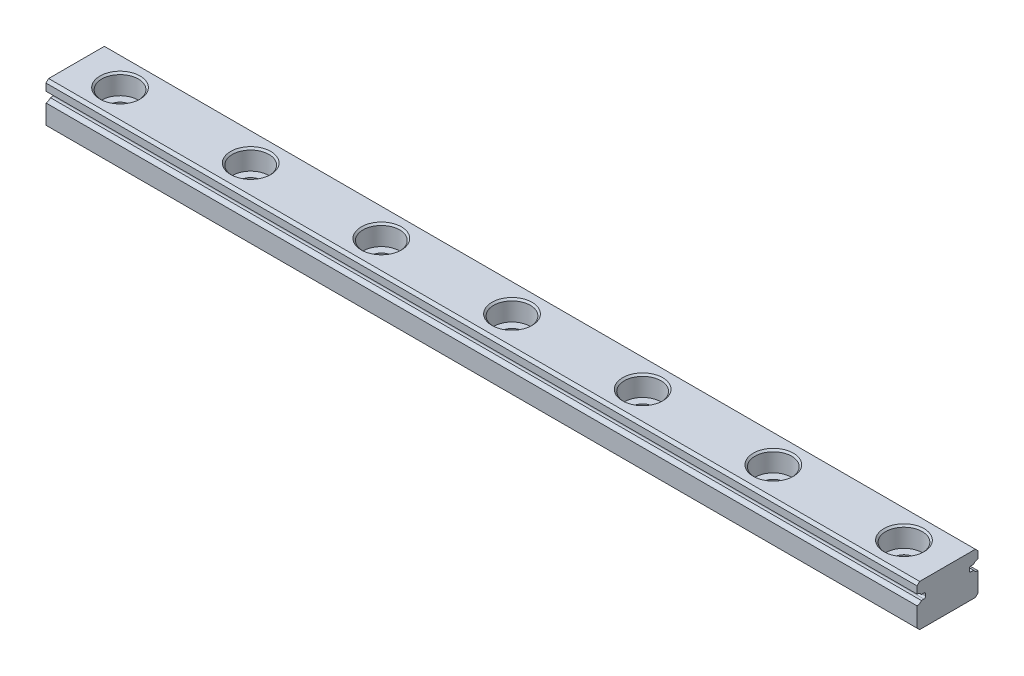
ISO-10303-21;
HEADER;
FILE_DESCRIPTION(('STEP AP214'),'2;1');
FILE_NAME('part.step','',(''),(''),'','','');
FILE_SCHEMA(('AUTOMOTIVE_DESIGN { 1 0 10303 214 1 1 1 1 }'));
ENDSEC;
DATA;
#1=APPLICATION_CONTEXT('core data for automotive mechanical design processes');
#2=APPLICATION_PROTOCOL_DEFINITION('international standard','automotive_design',2000,#1);
#3=PRODUCT_CONTEXT('',#1,'mechanical');
#4=PRODUCT('Part','Part','',(#3));
#5=PRODUCT_RELATED_PRODUCT_CATEGORY('part','',(#4));
#6=PRODUCT_DEFINITION_FORMATION('','',#4);
#7=PRODUCT_DEFINITION_CONTEXT('part definition',#1,'design');
#8=PRODUCT_DEFINITION('design','',#6,#7);
#9=PRODUCT_DEFINITION_SHAPE('','',#8);
#10=(LENGTH_UNIT() NAMED_UNIT(*) SI_UNIT(.MILLI.,.METRE.));
#11=(NAMED_UNIT(*) PLANE_ANGLE_UNIT() SI_UNIT($,.RADIAN.));
#12=(NAMED_UNIT(*) SI_UNIT($,.STERADIAN.) SOLID_ANGLE_UNIT());
#13=UNCERTAINTY_MEASURE_WITH_UNIT(LENGTH_MEASURE(1.E-05),#10,'distance_accuracy_value','');
#14=(GEOMETRIC_REPRESENTATION_CONTEXT(3) GLOBAL_UNCERTAINTY_ASSIGNED_CONTEXT((#13)) GLOBAL_UNIT_ASSIGNED_CONTEXT((#10,
#11,#12)) REPRESENTATION_CONTEXT('',''));
#15=CARTESIAN_POINT('',(0.,0.,0.));
#16=DIRECTION('',(0.,0.,1.));
#17=DIRECTION('',(1.,0.,0.));
#18=AXIS2_PLACEMENT_3D('',#15,#16,#17);
#19=CARTESIAN_POINT('',(100.,4.8,-3.2));
#20=DIRECTION('',(0.,-1.,0.));
#21=DIRECTION('',(0.,0.,-1.));
#22=AXIS2_PLACEMENT_3D('',#19,#20,#21);
#23=PLANE('',#22);
#24=DIRECTION('',(0.,0.,1.));
#25=VECTOR('',#24,1.);
#26=CARTESIAN_POINT('',(0.,4.8,-3.2));
#27=LINE('',#26,#25);
#28=CARTESIAN_POINT('',(0.,4.8,-3.2));
#29=VERTEX_POINT('',#28);
#30=CARTESIAN_POINT('',(0.,4.8,3.2));
#31=VERTEX_POINT('',#30);
#32=EDGE_CURVE('E11',#29,#31,#27,.T.);
#33=ORIENTED_EDGE('',*,*,#32,.T.);
#34=DIRECTION('',(-1.,0.,0.));
#35=VECTOR('',#34,1.);
#36=CARTESIAN_POINT('',(100.,4.8,3.2));
#37=LINE('',#36,#35);
#38=CARTESIAN_POINT('',(100.,4.8,3.2));
#39=VERTEX_POINT('',#38);
#40=EDGE_CURVE('E42',#39,#31,#37,.T.);
#41=ORIENTED_EDGE('',*,*,#40,.F.);
#42=DIRECTION('',(0.,0.,1.));
#43=VECTOR('',#42,1.);
#44=CARTESIAN_POINT('',(100.,4.8,-3.2));
#45=LINE('',#44,#43);
#46=CARTESIAN_POINT('',(100.,4.8,-3.2));
#47=VERTEX_POINT('',#46);
#48=EDGE_CURVE('E551',#47,#39,#45,.T.);
#49=ORIENTED_EDGE('',*,*,#48,.F.);
#50=DIRECTION('',(-1.,0.,0.));
#51=VECTOR('',#50,1.);
#52=CARTESIAN_POINT('',(100.,4.8,-3.2));
#53=LINE('',#52,#51);
#54=EDGE_CURVE('E28',#47,#29,#53,.T.);
#55=ORIENTED_EDGE('',*,*,#54,.T.);
#56=EDGE_LOOP('',(#33,#41,#49,#55));
#57=FACE_BOUND('',#56,.T.);
#58=CARTESIAN_POINT('',(5.,4.8,0.));
#59=DIRECTION('',(0.,-1.,0.));
#60=DIRECTION('',(0.,0.,-1.));
#61=AXIS2_PLACEMENT_3D('',#58,#59,#60);
#62=CIRCLE('',#61,2.305);
#63=CARTESIAN_POINT('',(5.,4.8,-2.305));
#64=VERTEX_POINT('',#63);
#65=EDGE_CURVE('E414',#64,#64,#62,.T.);
#66=ORIENTED_EDGE('',*,*,#65,.T.);
#67=EDGE_LOOP('',(#66));
#68=FACE_BOUND('',#67,.T.);
#69=CARTESIAN_POINT('',(35.,4.8,0.));
#70=DIRECTION('',(0.,-1.,0.));
#71=DIRECTION('',(0.,0.,-1.));
#72=AXIS2_PLACEMENT_3D('',#69,#70,#71);
#73=CIRCLE('',#72,2.305);
#74=CARTESIAN_POINT('',(35.,4.8,-2.305));
#75=VERTEX_POINT('',#74);
#76=EDGE_CURVE('E326',#75,#75,#73,.T.);
#77=ORIENTED_EDGE('',*,*,#76,.T.);
#78=EDGE_LOOP('',(#77));
#79=FACE_BOUND('',#78,.T.);
#80=CARTESIAN_POINT('',(50.,4.8,0.));
#81=DIRECTION('',(0.,-1.,0.));
#82=DIRECTION('',(0.,0.,-1.));
#83=AXIS2_PLACEMENT_3D('',#80,#81,#82);
#84=CIRCLE('',#83,2.305);
#85=CARTESIAN_POINT('',(50.,4.8,-2.305));
#86=VERTEX_POINT('',#85);
#87=EDGE_CURVE('E323',#86,#86,#84,.T.);
#88=ORIENTED_EDGE('',*,*,#87,.T.);
#89=EDGE_LOOP('',(#88));
#90=FACE_BOUND('',#89,.T.);
#91=CARTESIAN_POINT('',(65.,4.8,0.));
#92=DIRECTION('',(0.,-1.,0.));
#93=DIRECTION('',(0.,0.,-1.));
#94=AXIS2_PLACEMENT_3D('',#91,#92,#93);
#95=CIRCLE('',#94,2.305);
#96=CARTESIAN_POINT('',(65.,4.8,-2.305));
#97=VERTEX_POINT('',#96);
#98=EDGE_CURVE('E327',#97,#97,#95,.T.);
#99=ORIENTED_EDGE('',*,*,#98,.T.);
#100=EDGE_LOOP('',(#99));
#101=FACE_BOUND('',#100,.T.);
#102=CARTESIAN_POINT('',(80.,4.8,0.));
#103=DIRECTION('',(0.,-1.,0.));
#104=DIRECTION('',(0.,0.,-1.));
#105=AXIS2_PLACEMENT_3D('',#102,#103,#104);
#106=CIRCLE('',#105,2.305);
#107=CARTESIAN_POINT('',(80.,4.8,-2.305));
#108=VERTEX_POINT('',#107);
#109=EDGE_CURVE('E480',#108,#108,#106,.T.);
#110=ORIENTED_EDGE('',*,*,#109,.T.);
#111=EDGE_LOOP('',(#110));
#112=FACE_BOUND('',#111,.T.);
#113=CARTESIAN_POINT('',(95.,4.8,0.));
#114=DIRECTION('',(0.,-1.,0.));
#115=DIRECTION('',(0.,0.,-1.));
#116=AXIS2_PLACEMENT_3D('',#113,#114,#115);
#117=CIRCLE('',#116,2.305);
#118=CARTESIAN_POINT('',(95.,4.8,-2.305));
#119=VERTEX_POINT('',#118);
#120=EDGE_CURVE('E476',#119,#119,#117,.T.);
#121=ORIENTED_EDGE('',*,*,#120,.T.);
#122=EDGE_LOOP('',(#121));
#123=FACE_BOUND('',#122,.T.);
#124=CARTESIAN_POINT('',(20.,4.8,0.));
#125=DIRECTION('',(0.,-1.,0.));
#126=DIRECTION('',(0.,0.,-1.));
#127=AXIS2_PLACEMENT_3D('',#124,#125,#126);
#128=CIRCLE('',#127,2.305);
#129=CARTESIAN_POINT('',(20.,4.8,-2.305));
#130=VERTEX_POINT('',#129);
#131=EDGE_CURVE('E481',#130,#130,#128,.T.);
#132=ORIENTED_EDGE('',*,*,#131,.T.);
#133=EDGE_LOOP('',(#132));
#134=FACE_BOUND('',#133,.T.);
#135=ADVANCED_FACE('F17',(#57,#68,#79,#90,#101,#112,#123,#134),#23,.F.);
#136=CARTESIAN_POINT('',(100.,3.1,3.5));
#137=DIRECTION('',(1.,0.,0.));
#138=DIRECTION('',(0.,1.,0.));
#139=AXIS2_PLACEMENT_3D('',#136,#137,#138);
#140=PLANE('',#139);
#141=DIRECTION('',(0.,-0.707106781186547,0.707106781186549));
#142=VECTOR('',#141,1.);
#143=CARTESIAN_POINT('',(100.,4.8,3.2));
#144=LINE('',#143,#142);
#145=CARTESIAN_POINT('',(100.,4.5,3.5));
#146=VERTEX_POINT('',#145);
#147=EDGE_CURVE('E402',#39,#146,#144,.T.);
#148=ORIENTED_EDGE('',*,*,#147,.T.);
#149=DIRECTION('',(0.,-1.,0.));
#150=VECTOR('',#149,1.);
#151=CARTESIAN_POINT('',(100.,4.5,3.5));
#152=LINE('',#151,#150);
#153=CARTESIAN_POINT('',(100.,3.68309518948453,3.5));
#154=VERTEX_POINT('',#153);
#155=EDGE_CURVE('E381',#146,#154,#152,.T.);
#156=ORIENTED_EDGE('',*,*,#155,.T.);
#157=CARTESIAN_POINT('',(100.,3.1,3.5));
#158=DIRECTION('',(1.,0.,0.));
#159=DIRECTION('',(0.,0.,-1.));
#160=AXIS2_PLACEMENT_3D('',#157,#158,#159);
#161=CIRCLE('',#160,0.5830951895);
#162=CARTESIAN_POINT('',(100.,3.4,3.));
#163=VERTEX_POINT('',#162);
#164=EDGE_CURVE('E563',#163,#154,#161,.T.);
#165=ORIENTED_EDGE('',*,*,#164,.F.);
#166=DIRECTION('',(0.,0.,-1.));
#167=VECTOR('',#166,1.);
#168=CARTESIAN_POINT('',(100.,3.4,3.));
#169=LINE('',#168,#167);
#170=CARTESIAN_POINT('',(100.,3.4,2.7));
#171=VERTEX_POINT('',#170);
#172=EDGE_CURVE('E377',#163,#171,#169,.T.);
#173=ORIENTED_EDGE('',*,*,#172,.T.);
#174=CARTESIAN_POINT('',(100.,3.2,2.7));
#175=DIRECTION('',(1.,0.,0.));
#176=DIRECTION('',(0.,0.,-1.));
#177=AXIS2_PLACEMENT_3D('',#174,#175,#176);
#178=CIRCLE('',#177,0.2);
#179=CARTESIAN_POINT('',(100.,3.2,2.5));
#180=VERTEX_POINT('',#179);
#181=EDGE_CURVE('E424',#180,#171,#178,.T.);
#182=ORIENTED_EDGE('',*,*,#181,.F.);
#183=DIRECTION('',(0.,-1.,0.));
#184=VECTOR('',#183,1.);
#185=CARTESIAN_POINT('',(100.,3.2,2.5));
#186=LINE('',#185,#184);
#187=CARTESIAN_POINT('',(100.,3.,2.5));
#188=VERTEX_POINT('',#187);
#189=EDGE_CURVE('E332',#180,#188,#186,.T.);
#190=ORIENTED_EDGE('',*,*,#189,.T.);
#191=CARTESIAN_POINT('',(100.,3.,2.7));
#192=DIRECTION('',(1.,0.,0.));
#193=DIRECTION('',(0.,0.,-1.));
#194=AXIS2_PLACEMENT_3D('',#191,#192,#193);
#195=CIRCLE('',#194,0.2);
#196=CARTESIAN_POINT('',(100.,2.8,2.7));
#197=VERTEX_POINT('',#196);
#198=EDGE_CURVE('E348',#197,#188,#195,.T.);
#199=ORIENTED_EDGE('',*,*,#198,.F.);
#200=DIRECTION('',(0.,0.,1.));
#201=VECTOR('',#200,1.);
#202=CARTESIAN_POINT('',(100.,2.8,2.7));
#203=LINE('',#202,#201);
#204=CARTESIAN_POINT('',(100.,2.8,3.));
#205=VERTEX_POINT('',#204);
#206=EDGE_CURVE('E328',#197,#205,#203,.T.);
#207=ORIENTED_EDGE('',*,*,#206,.T.);
#208=CARTESIAN_POINT('',(100.,3.1,3.5));
#209=DIRECTION('',(1.,0.,0.));
#210=DIRECTION('',(0.,0.,-1.));
#211=AXIS2_PLACEMENT_3D('',#208,#209,#210);
#212=CIRCLE('',#211,0.5830951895);
#213=CARTESIAN_POINT('',(100.,2.51690481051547,3.5));
#214=VERTEX_POINT('',#213);
#215=EDGE_CURVE('E547',#214,#205,#212,.T.);
#216=ORIENTED_EDGE('',*,*,#215,.F.);
#217=DIRECTION('',(0.,-1.,0.));
#218=VECTOR('',#217,1.);
#219=CARTESIAN_POINT('',(100.,2.51690481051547,3.5));
#220=LINE('',#219,#218);
#221=CARTESIAN_POINT('',(100.,0.3,3.5));
#222=VERTEX_POINT('',#221);
#223=EDGE_CURVE('E297',#214,#222,#220,.T.);
#224=ORIENTED_EDGE('',*,*,#223,.T.);
#225=DIRECTION('',(0.,-0.707106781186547,-0.707106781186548));
#226=VECTOR('',#225,1.);
#227=CARTESIAN_POINT('',(100.,0.3,3.5));
#228=LINE('',#227,#226);
#229=CARTESIAN_POINT('',(100.,0.,3.2));
#230=VERTEX_POINT('',#229);
#231=EDGE_CURVE('E289',#222,#230,#228,.T.);
#232=ORIENTED_EDGE('',*,*,#231,.T.);
#233=DIRECTION('',(0.,0.,-1.));
#234=VECTOR('',#233,1.);
#235=CARTESIAN_POINT('',(100.,0.,3.2));
#236=LINE('',#235,#234);
#237=CARTESIAN_POINT('',(100.,0.,-3.2));
#238=VERTEX_POINT('',#237);
#239=EDGE_CURVE('E278',#230,#238,#236,.T.);
#240=ORIENTED_EDGE('',*,*,#239,.T.);
#241=DIRECTION('',(0.,0.707106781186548,-0.707106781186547));
#242=VECTOR('',#241,1.);
#243=CARTESIAN_POINT('',(100.,0.,-3.2));
#244=LINE('',#243,#242);
#245=CARTESIAN_POINT('',(100.,0.3,-3.5));
#246=VERTEX_POINT('',#245);
#247=EDGE_CURVE('E290',#238,#246,#244,.T.);
#248=ORIENTED_EDGE('',*,*,#247,.T.);
#249=DIRECTION('',(0.,1.,0.));
#250=VECTOR('',#249,1.);
#251=CARTESIAN_POINT('',(100.,0.3,-3.5));
#252=LINE('',#251,#250);
#253=CARTESIAN_POINT('',(100.,2.51690481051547,-3.5));
#254=VERTEX_POINT('',#253);
#255=EDGE_CURVE('E342',#246,#254,#252,.T.);
#256=ORIENTED_EDGE('',*,*,#255,.T.);
#257=CARTESIAN_POINT('',(100.,3.1,-3.5));
#258=DIRECTION('',(1.,0.,0.));
#259=DIRECTION('',(0.,0.,-1.));
#260=AXIS2_PLACEMENT_3D('',#257,#258,#259);
#261=CIRCLE('',#260,0.5830951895);
#262=CARTESIAN_POINT('',(100.,2.8,-3.));
#263=VERTEX_POINT('',#262);
#264=EDGE_CURVE('E163',#263,#254,#261,.T.);
#265=ORIENTED_EDGE('',*,*,#264,.F.);
#266=DIRECTION('',(0.,0.,1.));
#267=VECTOR('',#266,1.);
#268=CARTESIAN_POINT('',(100.,2.8,-3.));
#269=LINE('',#268,#267);
#270=CARTESIAN_POINT('',(100.,2.8,-2.7));
#271=VERTEX_POINT('',#270);
#272=EDGE_CURVE('E339',#263,#271,#269,.T.);
#273=ORIENTED_EDGE('',*,*,#272,.T.);
#274=CARTESIAN_POINT('',(100.,3.,-2.7));
#275=DIRECTION('',(1.,0.,0.));
#276=DIRECTION('',(0.,0.,-1.));
#277=AXIS2_PLACEMENT_3D('',#274,#275,#276);
#278=CIRCLE('',#277,0.2);
#279=CARTESIAN_POINT('',(100.,3.,-2.5));
#280=VERTEX_POINT('',#279);
#281=EDGE_CURVE('E177',#280,#271,#278,.T.);
#282=ORIENTED_EDGE('',*,*,#281,.F.);
#283=DIRECTION('',(0.,1.,0.));
#284=VECTOR('',#283,1.);
#285=CARTESIAN_POINT('',(100.,3.,-2.5));
#286=LINE('',#285,#284);
#287=CARTESIAN_POINT('',(100.,3.2,-2.5));
#288=VERTEX_POINT('',#287);
#289=EDGE_CURVE('E343',#280,#288,#286,.T.);
#290=ORIENTED_EDGE('',*,*,#289,.T.);
#291=CARTESIAN_POINT('',(100.,3.2,-2.7));
#292=DIRECTION('',(1.,0.,0.));
#293=DIRECTION('',(0.,0.,-1.));
#294=AXIS2_PLACEMENT_3D('',#291,#292,#293);
#295=CIRCLE('',#294,0.2);
#296=CARTESIAN_POINT('',(100.,3.4,-2.7));
#297=VERTEX_POINT('',#296);
#298=EDGE_CURVE('E484',#297,#288,#295,.T.);
#299=ORIENTED_EDGE('',*,*,#298,.F.);
#300=DIRECTION('',(0.,0.,-1.));
#301=VECTOR('',#300,1.);
#302=CARTESIAN_POINT('',(100.,3.4,-2.7));
#303=LINE('',#302,#301);
#304=CARTESIAN_POINT('',(100.,3.4,-3.));
#305=VERTEX_POINT('',#304);
#306=EDGE_CURVE('E337',#297,#305,#303,.T.);
#307=ORIENTED_EDGE('',*,*,#306,.T.);
#308=CARTESIAN_POINT('',(100.,3.1,-3.5));
#309=DIRECTION('',(1.,0.,0.));
#310=DIRECTION('',(0.,0.,-1.));
#311=AXIS2_PLACEMENT_3D('',#308,#309,#310);
#312=CIRCLE('',#311,0.5830951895);
#313=CARTESIAN_POINT('',(100.,3.68309518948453,-3.5));
#314=VERTEX_POINT('',#313);
#315=EDGE_CURVE('E594',#314,#305,#312,.T.);
#316=ORIENTED_EDGE('',*,*,#315,.F.);
#317=DIRECTION('',(0.,1.,0.));
#318=VECTOR('',#317,1.);
#319=CARTESIAN_POINT('',(100.,3.68309518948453,-3.5));
#320=LINE('',#319,#318);
#321=CARTESIAN_POINT('',(100.,4.5,-3.5));
#322=VERTEX_POINT('',#321);
#323=EDGE_CURVE('E333',#314,#322,#320,.T.);
#324=ORIENTED_EDGE('',*,*,#323,.T.);
#325=DIRECTION('',(0.,0.707106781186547,0.707106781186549));
#326=VECTOR('',#325,1.);
#327=CARTESIAN_POINT('',(100.,4.5,-3.5));
#328=LINE('',#327,#326);
#329=EDGE_CURVE('E338',#322,#47,#328,.T.);
#330=ORIENTED_EDGE('',*,*,#329,.T.);
#331=ORIENTED_EDGE('',*,*,#48,.T.);
#332=EDGE_LOOP('',(#148,#156,#165,#173,#182,#190,#199,#207,#216,#224,#232,#240,#248,#256,#265,
#273,#282,#290,#299,#307,#316,#324,#330,#331));
#333=FACE_BOUND('',#332,.T.);
#334=ADVANCED_FACE('F294',(#333),#140,.T.);
#335=CARTESIAN_POINT('',(100.,4.5,-3.5));
#336=DIRECTION('',(0.,-0.707106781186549,0.707106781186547));
#337=DIRECTION('',(-1.,0.,0.));
#338=AXIS2_PLACEMENT_3D('',#335,#336,#337);
#339=PLANE('',#338);
#340=DIRECTION('',(0.,0.707106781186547,0.707106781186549));
#341=VECTOR('',#340,1.);
#342=CARTESIAN_POINT('',(0.,4.5,-3.5));
#343=LINE('',#342,#341);
#344=CARTESIAN_POINT('',(0.,4.5,-3.5));
#345=VERTEX_POINT('',#344);
#346=EDGE_CURVE('E555',#345,#29,#343,.T.);
#347=ORIENTED_EDGE('',*,*,#346,.T.);
#348=ORIENTED_EDGE('',*,*,#54,.F.);
#349=ORIENTED_EDGE('',*,*,#329,.F.);
#350=DIRECTION('',(-1.,0.,0.));
#351=VECTOR('',#350,1.);
#352=CARTESIAN_POINT('',(100.,4.5,-3.5));
#353=LINE('',#352,#351);
#354=EDGE_CURVE('E559',#322,#345,#353,.T.);
#355=ORIENTED_EDGE('',*,*,#354,.T.);
#356=EDGE_LOOP('',(#347,#348,#349,#355));
#357=FACE_BOUND('',#356,.T.);
#358=ADVANCED_FACE('F923',(#357),#339,.F.);
#359=CARTESIAN_POINT('',(100.,4.8,3.2));
#360=DIRECTION('',(0.,-0.707106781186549,-0.707106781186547));
#361=DIRECTION('',(0.,0.707106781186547,-0.707106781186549));
#362=AXIS2_PLACEMENT_3D('',#359,#360,#361);
#363=PLANE('',#362);
#364=DIRECTION('',(0.,-0.707106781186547,0.707106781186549));
#365=VECTOR('',#364,1.);
#366=CARTESIAN_POINT('',(0.,4.8,3.2));
#367=LINE('',#366,#365);
#368=CARTESIAN_POINT('',(0.,4.5,3.5));
#369=VERTEX_POINT('',#368);
#370=EDGE_CURVE('E504',#31,#369,#367,.T.);
#371=ORIENTED_EDGE('',*,*,#370,.T.);
#372=DIRECTION('',(-1.,0.,0.));
#373=VECTOR('',#372,1.);
#374=CARTESIAN_POINT('',(100.,4.5,3.5));
#375=LINE('',#374,#373);
#376=EDGE_CURVE('E418',#146,#369,#375,.T.);
#377=ORIENTED_EDGE('',*,*,#376,.F.);
#378=ORIENTED_EDGE('',*,*,#147,.F.);
#379=ORIENTED_EDGE('',*,*,#40,.T.);
#380=EDGE_LOOP('',(#371,#377,#378,#379));
#381=FACE_BOUND('',#380,.T.);
#382=ADVANCED_FACE('F945',(#381),#363,.F.);
#383=CARTESIAN_POINT('',(100.,4.5,3.5));
#384=DIRECTION('',(0.,0.,-1.));
#385=DIRECTION('',(0.,-1.,0.));
#386=AXIS2_PLACEMENT_3D('',#383,#384,#385);
#387=PLANE('',#386);
#388=DIRECTION('',(0.,-1.,0.));
#389=VECTOR('',#388,1.);
#390=CARTESIAN_POINT('',(0.,4.5,3.5));
#391=LINE('',#390,#389);
#392=CARTESIAN_POINT('',(0.,3.68309518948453,3.5));
#393=VERTEX_POINT('',#392);
#394=EDGE_CURVE('E415',#369,#393,#391,.T.);
#395=ORIENTED_EDGE('',*,*,#394,.T.);
#396=DIRECTION('',(-1.,0.,0.));
#397=VECTOR('',#396,1.);
#398=CARTESIAN_POINT('',(100.,3.68309518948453,3.5));
#399=LINE('',#398,#397);
#400=EDGE_CURVE('E571',#154,#393,#399,.T.);
#401=ORIENTED_EDGE('',*,*,#400,.F.);
#402=ORIENTED_EDGE('',*,*,#155,.F.);
#403=ORIENTED_EDGE('',*,*,#376,.T.);
#404=EDGE_LOOP('',(#395,#401,#402,#403));
#405=FACE_BOUND('',#404,.T.);
#406=ADVANCED_FACE('F886',(#405),#387,.F.);
#407=CARTESIAN_POINT('',(100.,3.1,3.5));
#408=DIRECTION('',(1.,0.,0.));
#409=DIRECTION('',(0.,0.,1.));
#410=AXIS2_PLACEMENT_3D('',#407,#408,#409);
#411=CYLINDRICAL_SURFACE('',#410,0.5830951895);
#412=CARTESIAN_POINT('',(0.,3.1,3.5));
#413=DIRECTION('',(1.,0.,0.));
#414=DIRECTION('',(0.,0.,-1.));
#415=AXIS2_PLACEMENT_3D('',#412,#413,#414);
#416=CIRCLE('',#415,0.5830951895);
#417=CARTESIAN_POINT('',(0.,3.4,3.));
#418=VERTEX_POINT('',#417);
#419=EDGE_CURVE('E382',#418,#393,#416,.T.);
#420=ORIENTED_EDGE('',*,*,#419,.F.);
#421=DIRECTION('',(-1.,0.,0.));
#422=VECTOR('',#421,1.);
#423=CARTESIAN_POINT('',(100.,3.4,3.));
#424=LINE('',#423,#422);
#425=EDGE_CURVE('E428',#163,#418,#424,.T.);
#426=ORIENTED_EDGE('',*,*,#425,.F.);
#427=ORIENTED_EDGE('',*,*,#164,.T.);
#428=ORIENTED_EDGE('',*,*,#400,.T.);
#429=EDGE_LOOP('',(#420,#426,#427,#428));
#430=FACE_BOUND('',#429,.T.);
#431=ADVANCED_FACE('F880',(#430),#411,.F.);
#432=CARTESIAN_POINT('',(100.,3.4,3.));
#433=DIRECTION('',(0.,1.,0.));
#434=DIRECTION('',(1.,0.,0.));
#435=AXIS2_PLACEMENT_3D('',#432,#433,#434);
#436=PLANE('',#435);
#437=DIRECTION('',(0.,0.,-1.));
#438=VECTOR('',#437,1.);
#439=CARTESIAN_POINT('',(0.,3.4,3.));
#440=LINE('',#439,#438);
#441=CARTESIAN_POINT('',(0.,3.4,2.7));
#442=VERTEX_POINT('',#441);
#443=EDGE_CURVE('E432',#418,#442,#440,.T.);
#444=ORIENTED_EDGE('',*,*,#443,.T.);
#445=DIRECTION('',(-1.,0.,0.));
#446=VECTOR('',#445,1.);
#447=CARTESIAN_POINT('',(100.,3.4,2.7));
#448=LINE('',#447,#446);
#449=EDGE_CURVE('E420',#171,#442,#448,.T.);
#450=ORIENTED_EDGE('',*,*,#449,.F.);
#451=ORIENTED_EDGE('',*,*,#172,.F.);
#452=ORIENTED_EDGE('',*,*,#425,.T.);
#453=EDGE_LOOP('',(#444,#450,#451,#452));
#454=FACE_BOUND('',#453,.T.);
#455=ADVANCED_FACE('F890',(#454),#436,.F.);
#456=CARTESIAN_POINT('',(100.,3.2,2.7));
#457=DIRECTION('',(1.,0.,0.));
#458=DIRECTION('',(0.,0.,1.));
#459=AXIS2_PLACEMENT_3D('',#456,#457,#458);
#460=CYLINDRICAL_SURFACE('',#459,0.2);
#461=CARTESIAN_POINT('',(0.,3.2,2.7));
#462=DIRECTION('',(1.,0.,0.));
#463=DIRECTION('',(0.,0.,-1.));
#464=AXIS2_PLACEMENT_3D('',#461,#462,#463);
#465=CIRCLE('',#464,0.2);
#466=CARTESIAN_POINT('',(0.,3.2,2.5));
#467=VERTEX_POINT('',#466);
#468=EDGE_CURVE('E386',#467,#442,#465,.T.);
#469=ORIENTED_EDGE('',*,*,#468,.F.);
#470=DIRECTION('',(-1.,0.,0.));
#471=VECTOR('',#470,1.);
#472=CARTESIAN_POINT('',(100.,3.2,2.5));
#473=LINE('',#472,#471);
#474=EDGE_CURVE('E498',#180,#467,#473,.T.);
#475=ORIENTED_EDGE('',*,*,#474,.F.);
#476=ORIENTED_EDGE('',*,*,#181,.T.);
#477=ORIENTED_EDGE('',*,*,#449,.T.);
#478=EDGE_LOOP('',(#469,#475,#476,#477));
#479=FACE_BOUND('',#478,.T.);
#480=ADVANCED_FACE('F893',(#479),#460,.F.);
#481=CARTESIAN_POINT('',(100.,3.2,2.5));
#482=DIRECTION('',(0.,0.,-1.));
#483=DIRECTION('',(0.,-1.,0.));
#484=AXIS2_PLACEMENT_3D('',#481,#482,#483);
#485=PLANE('',#484);
#486=DIRECTION('',(0.,-1.,0.));
#487=VECTOR('',#486,1.);
#488=CARTESIAN_POINT('',(0.,3.2,2.5));
#489=LINE('',#488,#487);
#490=CARTESIAN_POINT('',(0.,3.,2.5));
#491=VERTEX_POINT('',#490);
#492=EDGE_CURVE('E425',#467,#491,#489,.T.);
#493=ORIENTED_EDGE('',*,*,#492,.T.);
#494=DIRECTION('',(-1.,0.,0.));
#495=VECTOR('',#494,1.);
#496=CARTESIAN_POINT('',(100.,3.,2.5));
#497=LINE('',#496,#495);
#498=EDGE_CURVE('E344',#188,#491,#497,.T.);
#499=ORIENTED_EDGE('',*,*,#498,.F.);
#500=ORIENTED_EDGE('',*,*,#189,.F.);
#501=ORIENTED_EDGE('',*,*,#474,.T.);
#502=EDGE_LOOP('',(#493,#499,#500,#501));
#503=FACE_BOUND('',#502,.T.);
#504=ADVANCED_FACE('F645',(#503),#485,.F.);
#505=CARTESIAN_POINT('',(100.,3.,2.7));
#506=DIRECTION('',(1.,0.,0.));
#507=DIRECTION('',(0.,0.,1.));
#508=AXIS2_PLACEMENT_3D('',#505,#506,#507);
#509=CYLINDRICAL_SURFACE('',#508,0.2);
#510=CARTESIAN_POINT('',(0.,3.,2.7));
#511=DIRECTION('',(1.,0.,0.));
#512=DIRECTION('',(0.,0.,-1.));
#513=AXIS2_PLACEMENT_3D('',#510,#511,#512);
#514=CIRCLE('',#513,0.2);
#515=CARTESIAN_POINT('',(0.,2.8,2.7));
#516=VERTEX_POINT('',#515);
#517=EDGE_CURVE('E390',#516,#491,#514,.T.);
#518=ORIENTED_EDGE('',*,*,#517,.F.);
#519=DIRECTION('',(-1.,0.,0.));
#520=VECTOR('',#519,1.);
#521=CARTESIAN_POINT('',(100.,2.8,2.7));
#522=LINE('',#521,#520);
#523=EDGE_CURVE('E410',#197,#516,#522,.T.);
#524=ORIENTED_EDGE('',*,*,#523,.F.);
#525=ORIENTED_EDGE('',*,*,#198,.T.);
#526=ORIENTED_EDGE('',*,*,#498,.T.);
#527=EDGE_LOOP('',(#518,#524,#525,#526));
#528=FACE_BOUND('',#527,.T.);
#529=ADVANCED_FACE('F649',(#528),#509,.F.);
#530=CARTESIAN_POINT('',(100.,2.8,2.7));
#531=DIRECTION('',(0.,-1.,0.));
#532=DIRECTION('',(0.,0.,-1.));
#533=AXIS2_PLACEMENT_3D('',#530,#531,#532);
#534=PLANE('',#533);
#535=DIRECTION('',(0.,0.,1.));
#536=VECTOR('',#535,1.);
#537=CARTESIAN_POINT('',(0.,2.8,2.7));
#538=LINE('',#537,#536);
#539=CARTESIAN_POINT('',(0.,2.8,3.));
#540=VERTEX_POINT('',#539);
#541=EDGE_CURVE('E349',#516,#540,#538,.T.);
#542=ORIENTED_EDGE('',*,*,#541,.T.);
#543=DIRECTION('',(-1.,0.,0.));
#544=VECTOR('',#543,1.);
#545=CARTESIAN_POINT('',(100.,2.8,3.));
#546=LINE('',#545,#544);
#547=EDGE_CURVE('E543',#205,#540,#546,.T.);
#548=ORIENTED_EDGE('',*,*,#547,.F.);
#549=ORIENTED_EDGE('',*,*,#206,.F.);
#550=ORIENTED_EDGE('',*,*,#523,.T.);
#551=EDGE_LOOP('',(#542,#548,#549,#550));
#552=FACE_BOUND('',#551,.T.);
#553=ADVANCED_FACE('F898',(#552),#534,.F.);
#554=CARTESIAN_POINT('',(100.,3.1,3.5));
#555=DIRECTION('',(1.,0.,0.));
#556=DIRECTION('',(0.,0.,1.));
#557=AXIS2_PLACEMENT_3D('',#554,#555,#556);
#558=CYLINDRICAL_SURFACE('',#557,0.5830951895);
#559=CARTESIAN_POINT('',(0.,3.1,3.5));
#560=DIRECTION('',(1.,0.,0.));
#561=DIRECTION('',(0.,0.,-1.));
#562=AXIS2_PLACEMENT_3D('',#559,#560,#561);
#563=CIRCLE('',#562,0.5830951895);
#564=CARTESIAN_POINT('',(0.,2.51690481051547,3.5));
#565=VERTEX_POINT('',#564);
#566=EDGE_CURVE('E361',#565,#540,#563,.T.);
#567=ORIENTED_EDGE('',*,*,#566,.F.);
#568=DIRECTION('',(-1.,0.,0.));
#569=VECTOR('',#568,1.);
#570=CARTESIAN_POINT('',(100.,2.51690481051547,3.5));
#571=LINE('',#570,#569);
#572=EDGE_CURVE('E394',#214,#565,#571,.T.);
#573=ORIENTED_EDGE('',*,*,#572,.F.);
#574=ORIENTED_EDGE('',*,*,#215,.T.);
#575=ORIENTED_EDGE('',*,*,#547,.T.);
#576=EDGE_LOOP('',(#567,#573,#574,#575));
#577=FACE_BOUND('',#576,.T.);
#578=ADVANCED_FACE('F903',(#577),#558,.F.);
#579=CARTESIAN_POINT('',(100.,2.51690481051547,3.5));
#580=DIRECTION('',(0.,0.,-1.));
#581=DIRECTION('',(0.,-1.,0.));
#582=AXIS2_PLACEMENT_3D('',#579,#580,#581);
#583=PLANE('',#582);
#584=DIRECTION('',(0.,-1.,0.));
#585=VECTOR('',#584,1.);
#586=CARTESIAN_POINT('',(0.,2.51690481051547,3.5));
#587=LINE('',#586,#585);
#588=CARTESIAN_POINT('',(0.,0.3,3.5));
#589=VERTEX_POINT('',#588);
#590=EDGE_CURVE('E398',#565,#589,#587,.T.);
#591=ORIENTED_EDGE('',*,*,#590,.T.);
#592=DIRECTION('',(-1.,0.,0.));
#593=VECTOR('',#592,1.);
#594=CARTESIAN_POINT('',(100.,0.3,3.5));
#595=LINE('',#594,#593);
#596=EDGE_CURVE('E314',#222,#589,#595,.T.);
#597=ORIENTED_EDGE('',*,*,#596,.F.);
#598=ORIENTED_EDGE('',*,*,#223,.F.);
#599=ORIENTED_EDGE('',*,*,#572,.T.);
#600=EDGE_LOOP('',(#591,#597,#598,#599));
#601=FACE_BOUND('',#600,.T.);
#602=ADVANCED_FACE('F902',(#601),#583,.F.);
#603=CARTESIAN_POINT('',(100.,0.3,3.5));
#604=DIRECTION('',(0.,0.707106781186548,-0.707106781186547));
#605=DIRECTION('',(-1.,0.,0.));
#606=AXIS2_PLACEMENT_3D('',#603,#604,#605);
#607=PLANE('',#606);
#608=DIRECTION('',(0.,-0.707106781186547,-0.707106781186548));
#609=VECTOR('',#608,1.);
#610=CARTESIAN_POINT('',(0.,0.3,3.5));
#611=LINE('',#610,#609);
#612=CARTESIAN_POINT('',(0.,0.,3.2));
#613=VERTEX_POINT('',#612);
#614=EDGE_CURVE('E304',#589,#613,#611,.T.);
#615=ORIENTED_EDGE('',*,*,#614,.T.);
#616=DIRECTION('',(-1.,0.,0.));
#617=VECTOR('',#616,1.);
#618=CARTESIAN_POINT('',(100.,0.,3.2));
#619=LINE('',#618,#617);
#620=EDGE_CURVE('E284',#230,#613,#619,.T.);
#621=ORIENTED_EDGE('',*,*,#620,.F.);
#622=ORIENTED_EDGE('',*,*,#231,.F.);
#623=ORIENTED_EDGE('',*,*,#596,.T.);
#624=EDGE_LOOP('',(#615,#621,#622,#623));
#625=FACE_BOUND('',#624,.T.);
#626=ADVANCED_FACE('F302',(#625),#607,.F.);
#627=CARTESIAN_POINT('',(100.,0.,3.2));
#628=DIRECTION('',(0.,1.,0.));
#629=DIRECTION('',(1.,0.,0.));
#630=AXIS2_PLACEMENT_3D('',#627,#628,#629);
#631=PLANE('',#630);
#632=DIRECTION('',(0.,0.,-1.));
#633=VECTOR('',#632,1.);
#634=CARTESIAN_POINT('',(0.,0.,3.2));
#635=LINE('',#634,#633);
#636=CARTESIAN_POINT('',(0.,0.,-3.2));
#637=VERTEX_POINT('',#636);
#638=EDGE_CURVE('E307',#613,#637,#635,.T.);
#639=ORIENTED_EDGE('',*,*,#638,.T.);
#640=DIRECTION('',(-1.,0.,0.));
#641=VECTOR('',#640,1.);
#642=CARTESIAN_POINT('',(100.,0.,-3.2));
#643=LINE('',#642,#641);
#644=EDGE_CURVE('E286',#238,#637,#643,.T.);
#645=ORIENTED_EDGE('',*,*,#644,.F.);
#646=ORIENTED_EDGE('',*,*,#239,.F.);
#647=ORIENTED_EDGE('',*,*,#620,.T.);
#648=EDGE_LOOP('',(#639,#645,#646,#647));
#649=FACE_BOUND('',#648,.T.);
#650=CARTESIAN_POINT('',(5.,0.,0.));
#651=DIRECTION('',(0.,-1.,0.));
#652=DIRECTION('',(0.,0.,-1.));
#653=AXIS2_PLACEMENT_3D('',#650,#651,#652);
#654=CIRCLE('',#653,1.405);
#655=CARTESIAN_POINT('',(5.,0.,-1.405));
#656=VERTEX_POINT('',#655);
#657=EDGE_CURVE('E366',#656,#656,#654,.T.);
#658=ORIENTED_EDGE('',*,*,#657,.F.);
#659=EDGE_LOOP('',(#658));
#660=FACE_BOUND('',#659,.T.);
#661=CARTESIAN_POINT('',(35.,0.,0.));
#662=DIRECTION('',(0.,-1.,0.));
#663=DIRECTION('',(0.,0.,-1.));
#664=AXIS2_PLACEMENT_3D('',#661,#662,#663);
#665=CIRCLE('',#664,1.405);
#666=CARTESIAN_POINT('',(35.,0.,-1.405));
#667=VERTEX_POINT('',#666);
#668=EDGE_CURVE('E321',#667,#667,#665,.T.);
#669=ORIENTED_EDGE('',*,*,#668,.F.);
#670=EDGE_LOOP('',(#669));
#671=FACE_BOUND('',#670,.T.);
#672=CARTESIAN_POINT('',(50.,0.,0.));
#673=DIRECTION('',(0.,-1.,0.));
#674=DIRECTION('',(0.,0.,-1.));
#675=AXIS2_PLACEMENT_3D('',#672,#673,#674);
#676=CIRCLE('',#675,1.405);
#677=CARTESIAN_POINT('',(50.,0.,-1.405));
#678=VERTEX_POINT('',#677);
#679=EDGE_CURVE('E585',#678,#678,#676,.T.);
#680=ORIENTED_EDGE('',*,*,#679,.F.);
#681=EDGE_LOOP('',(#680));
#682=FACE_BOUND('',#681,.T.);
#683=CARTESIAN_POINT('',(65.,0.,0.));
#684=DIRECTION('',(0.,-1.,0.));
#685=DIRECTION('',(0.,0.,-1.));
#686=AXIS2_PLACEMENT_3D('',#683,#684,#685);
#687=CIRCLE('',#686,1.405);
#688=CARTESIAN_POINT('',(65.,0.,-1.405));
#689=VERTEX_POINT('',#688);
#690=EDGE_CURVE('E587',#689,#689,#687,.T.);
#691=ORIENTED_EDGE('',*,*,#690,.F.);
#692=EDGE_LOOP('',(#691));
#693=FACE_BOUND('',#692,.T.);
#694=CARTESIAN_POINT('',(80.,0.,0.));
#695=DIRECTION('',(0.,-1.,0.));
#696=DIRECTION('',(0.,0.,-1.));
#697=AXIS2_PLACEMENT_3D('',#694,#695,#696);
#698=CIRCLE('',#697,1.405);
#699=CARTESIAN_POINT('',(80.,0.,-1.405));
#700=VERTEX_POINT('',#699);
#701=EDGE_CURVE('E475',#700,#700,#698,.T.);
#702=ORIENTED_EDGE('',*,*,#701,.F.);
#703=EDGE_LOOP('',(#702));
#704=FACE_BOUND('',#703,.T.);
#705=CARTESIAN_POINT('',(95.,0.,0.));
#706=DIRECTION('',(0.,-1.,0.));
#707=DIRECTION('',(0.,0.,-1.));
#708=AXIS2_PLACEMENT_3D('',#705,#706,#707);
#709=CIRCLE('',#708,1.405);
#710=CARTESIAN_POINT('',(95.,0.,-1.405));
#711=VERTEX_POINT('',#710);
#712=EDGE_CURVE('E523',#711,#711,#709,.T.);
#713=ORIENTED_EDGE('',*,*,#712,.F.);
#714=EDGE_LOOP('',(#713));
#715=FACE_BOUND('',#714,.T.);
#716=CARTESIAN_POINT('',(20.,0.,0.));
#717=DIRECTION('',(0.,-1.,0.));
#718=DIRECTION('',(0.,0.,-1.));
#719=AXIS2_PLACEMENT_3D('',#716,#717,#718);
#720=CIRCLE('',#719,1.405);
#721=CARTESIAN_POINT('',(20.,0.,-1.405));
#722=VERTEX_POINT('',#721);
#723=EDGE_CURVE('E433',#722,#722,#720,.T.);
#724=ORIENTED_EDGE('',*,*,#723,.F.);
#725=EDGE_LOOP('',(#724));
#726=FACE_BOUND('',#725,.T.);
#727=ADVANCED_FACE('F281',(#649,#660,#671,#682,#693,#704,#715,#726),#631,.F.);
#728=CARTESIAN_POINT('',(100.,0.,-3.2));
#729=DIRECTION('',(0.,0.707106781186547,0.707106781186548));
#730=DIRECTION('',(1.,0.,0.));
#731=AXIS2_PLACEMENT_3D('',#728,#729,#730);
#732=PLANE('',#731);
#733=DIRECTION('',(0.,0.707106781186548,-0.707106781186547));
#734=VECTOR('',#733,1.);
#735=CARTESIAN_POINT('',(0.,0.,-3.2));
#736=LINE('',#735,#734);
#737=CARTESIAN_POINT('',(0.,0.3,-3.5));
#738=VERTEX_POINT('',#737);
#739=EDGE_CURVE('E308',#637,#738,#736,.T.);
#740=ORIENTED_EDGE('',*,*,#739,.T.);
#741=DIRECTION('',(-1.,0.,0.));
#742=VECTOR('',#741,1.);
#743=CARTESIAN_POINT('',(100.,0.3,-3.5));
#744=LINE('',#743,#742);
#745=EDGE_CURVE('E454',#246,#738,#744,.T.);
#746=ORIENTED_EDGE('',*,*,#745,.F.);
#747=ORIENTED_EDGE('',*,*,#247,.F.);
#748=ORIENTED_EDGE('',*,*,#644,.T.);
#749=EDGE_LOOP('',(#740,#746,#747,#748));
#750=FACE_BOUND('',#749,.T.);
#751=ADVANCED_FACE('F1027',(#750),#732,.F.);
#752=CARTESIAN_POINT('',(100.,0.3,-3.5));
#753=DIRECTION('',(0.,0.,1.));
#754=DIRECTION('',(1.,0.,0.));
#755=AXIS2_PLACEMENT_3D('',#752,#753,#754);
#756=PLANE('',#755);
#757=DIRECTION('',(0.,1.,0.));
#758=VECTOR('',#757,1.);
#759=CARTESIAN_POINT('',(0.,0.3,-3.5));
#760=LINE('',#759,#758);
#761=CARTESIAN_POINT('',(0.,2.51690481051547,-3.5));
#762=VERTEX_POINT('',#761);
#763=EDGE_CURVE('E450',#738,#762,#760,.T.);
#764=ORIENTED_EDGE('',*,*,#763,.T.);
#765=DIRECTION('',(-1.,0.,0.));
#766=VECTOR('',#765,1.);
#767=CARTESIAN_POINT('',(100.,2.51690481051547,-3.5));
#768=LINE('',#767,#766);
#769=EDGE_CURVE('E580',#254,#762,#768,.T.);
#770=ORIENTED_EDGE('',*,*,#769,.F.);
#771=ORIENTED_EDGE('',*,*,#255,.F.);
#772=ORIENTED_EDGE('',*,*,#745,.T.);
#773=EDGE_LOOP('',(#764,#770,#771,#772));
#774=FACE_BOUND('',#773,.T.);
#775=ADVANCED_FACE('F808',(#774),#756,.F.);
#776=CARTESIAN_POINT('',(100.,3.1,-3.5));
#777=DIRECTION('',(1.,0.,0.));
#778=DIRECTION('',(0.,0.,1.));
#779=AXIS2_PLACEMENT_3D('',#776,#777,#778);
#780=CYLINDRICAL_SURFACE('',#779,0.5830951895);
#781=CARTESIAN_POINT('',(0.,3.1,-3.5));
#782=DIRECTION('',(1.,0.,0.));
#783=DIRECTION('',(0.,0.,-1.));
#784=AXIS2_PLACEMENT_3D('',#781,#782,#783);
#785=CIRCLE('',#784,0.5830951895);
#786=CARTESIAN_POINT('',(0.,2.8,-3.));
#787=VERTEX_POINT('',#786);
#788=EDGE_CURVE('E356',#787,#762,#785,.T.);
#789=ORIENTED_EDGE('',*,*,#788,.F.);
#790=DIRECTION('',(-1.,0.,0.));
#791=VECTOR('',#790,1.);
#792=CARTESIAN_POINT('',(100.,2.8,-3.));
#793=LINE('',#792,#791);
#794=EDGE_CURVE('E445',#263,#787,#793,.T.);
#795=ORIENTED_EDGE('',*,*,#794,.F.);
#796=ORIENTED_EDGE('',*,*,#264,.T.);
#797=ORIENTED_EDGE('',*,*,#769,.T.);
#798=EDGE_LOOP('',(#789,#795,#796,#797));
#799=FACE_BOUND('',#798,.T.);
#800=ADVANCED_FACE('F804',(#799),#780,.F.);
#801=CARTESIAN_POINT('',(100.,2.8,-3.));
#802=DIRECTION('',(0.,-1.,0.));
#803=DIRECTION('',(0.,0.,-1.));
#804=AXIS2_PLACEMENT_3D('',#801,#802,#803);
#805=PLANE('',#804);
#806=DIRECTION('',(0.,0.,1.));
#807=VECTOR('',#806,1.);
#808=CARTESIAN_POINT('',(0.,2.8,-3.));
#809=LINE('',#808,#807);
#810=CARTESIAN_POINT('',(0.,2.8,-2.7));
#811=VERTEX_POINT('',#810);
#812=EDGE_CURVE('E449',#787,#811,#809,.T.);
#813=ORIENTED_EDGE('',*,*,#812,.T.);
#814=DIRECTION('',(-1.,0.,0.));
#815=VECTOR('',#814,1.);
#816=CARTESIAN_POINT('',(100.,2.8,-2.7));
#817=LINE('',#816,#815);
#818=EDGE_CURVE('E494',#271,#811,#817,.T.);
#819=ORIENTED_EDGE('',*,*,#818,.F.);
#820=ORIENTED_EDGE('',*,*,#272,.F.);
#821=ORIENTED_EDGE('',*,*,#794,.T.);
#822=EDGE_LOOP('',(#813,#819,#820,#821));
#823=FACE_BOUND('',#822,.T.);
#824=ADVANCED_FACE('F969',(#823),#805,.F.);
#825=CARTESIAN_POINT('',(100.,3.,-2.7));
#826=DIRECTION('',(1.,0.,0.));
#827=DIRECTION('',(0.,0.,1.));
#828=AXIS2_PLACEMENT_3D('',#825,#826,#827);
#829=CYLINDRICAL_SURFACE('',#828,0.2);
#830=CARTESIAN_POINT('',(0.,3.,-2.7));
#831=DIRECTION('',(1.,0.,0.));
#832=DIRECTION('',(0.,0.,-1.));
#833=AXIS2_PLACEMENT_3D('',#830,#831,#832);
#834=CIRCLE('',#833,0.2);
#835=CARTESIAN_POINT('',(0.,3.,-2.5));
#836=VERTEX_POINT('',#835);
#837=EDGE_CURVE('E360',#836,#811,#834,.T.);
#838=ORIENTED_EDGE('',*,*,#837,.F.);
#839=DIRECTION('',(-1.,0.,0.));
#840=VECTOR('',#839,1.);
#841=CARTESIAN_POINT('',(100.,3.,-2.5));
#842=LINE('',#841,#840);
#843=EDGE_CURVE('E567',#280,#836,#842,.T.);
#844=ORIENTED_EDGE('',*,*,#843,.F.);
#845=ORIENTED_EDGE('',*,*,#281,.T.);
#846=ORIENTED_EDGE('',*,*,#818,.T.);
#847=EDGE_LOOP('',(#838,#844,#845,#846));
#848=FACE_BOUND('',#847,.T.);
#849=ADVANCED_FACE('F816',(#848),#829,.F.);
#850=CARTESIAN_POINT('',(100.,3.,-2.5));
#851=DIRECTION('',(0.,0.,1.));
#852=DIRECTION('',(1.,0.,0.));
#853=AXIS2_PLACEMENT_3D('',#850,#851,#852);
#854=PLANE('',#853);
#855=DIRECTION('',(0.,1.,0.));
#856=VECTOR('',#855,1.);
#857=CARTESIAN_POINT('',(0.,3.,-2.5));
#858=LINE('',#857,#856);
#859=CARTESIAN_POINT('',(0.,3.2,-2.5));
#860=VERTEX_POINT('',#859);
#861=EDGE_CURVE('E507',#836,#860,#858,.T.);
#862=ORIENTED_EDGE('',*,*,#861,.T.);
#863=DIRECTION('',(-1.,0.,0.));
#864=VECTOR('',#863,1.);
#865=CARTESIAN_POINT('',(100.,3.2,-2.5));
#866=LINE('',#865,#864);
#867=EDGE_CURVE('E468',#288,#860,#866,.T.);
#868=ORIENTED_EDGE('',*,*,#867,.F.);
#869=ORIENTED_EDGE('',*,*,#289,.F.);
#870=ORIENTED_EDGE('',*,*,#843,.T.);
#871=EDGE_LOOP('',(#862,#868,#869,#870));
#872=FACE_BOUND('',#871,.T.);
#873=ADVANCED_FACE('F819',(#872),#854,.F.);
#874=CARTESIAN_POINT('',(100.,3.2,-2.7));
#875=DIRECTION('',(1.,0.,0.));
#876=DIRECTION('',(0.,0.,1.));
#877=AXIS2_PLACEMENT_3D('',#874,#875,#876);
#878=CYLINDRICAL_SURFACE('',#877,0.2);
#879=CARTESIAN_POINT('',(0.,3.2,-2.7));
#880=DIRECTION('',(1.,0.,0.));
#881=DIRECTION('',(0.,0.,-1.));
#882=AXIS2_PLACEMENT_3D('',#879,#880,#881);
#883=CIRCLE('',#882,0.2);
#884=CARTESIAN_POINT('',(0.,3.4,-2.7));
#885=VERTEX_POINT('',#884);
#886=EDGE_CURVE('E437',#885,#860,#883,.T.);
#887=ORIENTED_EDGE('',*,*,#886,.F.);
#888=DIRECTION('',(-1.,0.,0.));
#889=VECTOR('',#888,1.);
#890=CARTESIAN_POINT('',(100.,3.4,-2.7));
#891=LINE('',#890,#889);
#892=EDGE_CURVE('E469',#297,#885,#891,.T.);
#893=ORIENTED_EDGE('',*,*,#892,.F.);
#894=ORIENTED_EDGE('',*,*,#298,.T.);
#895=ORIENTED_EDGE('',*,*,#867,.T.);
#896=EDGE_LOOP('',(#887,#893,#894,#895));
#897=FACE_BOUND('',#896,.T.);
#898=ADVANCED_FACE('F953',(#897),#878,.F.);
#899=CARTESIAN_POINT('',(100.,3.4,-2.7));
#900=DIRECTION('',(0.,1.,0.));
#901=DIRECTION('',(1.,0.,0.));
#902=AXIS2_PLACEMENT_3D('',#899,#900,#901);
#903=PLANE('',#902);
#904=DIRECTION('',(0.,0.,-1.));
#905=VECTOR('',#904,1.);
#906=CARTESIAN_POINT('',(0.,3.4,-2.7));
#907=LINE('',#906,#905);
#908=CARTESIAN_POINT('',(0.,3.4,-3.));
#909=VERTEX_POINT('',#908);
#910=EDGE_CURVE('E464',#885,#909,#907,.T.);
#911=ORIENTED_EDGE('',*,*,#910,.T.);
#912=DIRECTION('',(-1.,0.,0.));
#913=VECTOR('',#912,1.);
#914=CARTESIAN_POINT('',(100.,3.4,-3.));
#915=LINE('',#914,#913);
#916=EDGE_CURVE('E577',#305,#909,#915,.T.);
#917=ORIENTED_EDGE('',*,*,#916,.F.);
#918=ORIENTED_EDGE('',*,*,#306,.F.);
#919=ORIENTED_EDGE('',*,*,#892,.T.);
#920=EDGE_LOOP('',(#911,#917,#918,#919));
#921=FACE_BOUND('',#920,.T.);
#922=ADVANCED_FACE('F956',(#921),#903,.F.);
#923=CARTESIAN_POINT('',(100.,3.1,-3.5));
#924=DIRECTION('',(1.,0.,0.));
#925=DIRECTION('',(0.,0.,1.));
#926=AXIS2_PLACEMENT_3D('',#923,#924,#925);
#927=CYLINDRICAL_SURFACE('',#926,0.5830951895);
#928=CARTESIAN_POINT('',(0.,3.1,-3.5));
#929=DIRECTION('',(1.,0.,0.));
#930=DIRECTION('',(0.,0.,-1.));
#931=AXIS2_PLACEMENT_3D('',#928,#929,#930);
#932=CIRCLE('',#931,0.5830951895);
#933=CARTESIAN_POINT('',(0.,3.68309518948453,-3.5));
#934=VERTEX_POINT('',#933);
#935=EDGE_CURVE('E441',#934,#909,#932,.T.);
#936=ORIENTED_EDGE('',*,*,#935,.F.);
#937=DIRECTION('',(-1.,0.,0.));
#938=VECTOR('',#937,1.);
#939=CARTESIAN_POINT('',(100.,3.68309518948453,-3.5));
#940=LINE('',#939,#938);
#941=EDGE_CURVE('E508',#314,#934,#940,.T.);
#942=ORIENTED_EDGE('',*,*,#941,.F.);
#943=ORIENTED_EDGE('',*,*,#315,.T.);
#944=ORIENTED_EDGE('',*,*,#916,.T.);
#945=EDGE_LOOP('',(#936,#942,#943,#944));
#946=FACE_BOUND('',#945,.T.);
#947=ADVANCED_FACE('F941',(#946),#927,.F.);
#948=CARTESIAN_POINT('',(100.,3.68309518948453,-3.5));
#949=DIRECTION('',(0.,0.,1.));
#950=DIRECTION('',(1.,0.,0.));
#951=AXIS2_PLACEMENT_3D('',#948,#949,#950);
#952=PLANE('',#951);
#953=DIRECTION('',(0.,1.,0.));
#954=VECTOR('',#953,1.);
#955=CARTESIAN_POINT('',(0.,3.68309518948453,-3.5));
#956=LINE('',#955,#954);
#957=EDGE_CURVE('E511',#934,#345,#956,.T.);
#958=ORIENTED_EDGE('',*,*,#957,.T.);
#959=ORIENTED_EDGE('',*,*,#354,.F.);
#960=ORIENTED_EDGE('',*,*,#323,.F.);
#961=ORIENTED_EDGE('',*,*,#941,.T.);
#962=EDGE_LOOP('',(#958,#959,#960,#961));
#963=FACE_BOUND('',#962,.T.);
#964=ADVANCED_FACE('F937',(#963),#952,.F.);
#965=CARTESIAN_POINT('',(20.,4.8,0.));
#966=DIRECTION('',(0.,1.,0.));
#967=DIRECTION('',(0.,0.,1.));
#968=AXIS2_PLACEMENT_3D('',#965,#966,#967);
#969=CONICAL_SURFACE('',#968,2.305,0.7853981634);
#970=ORIENTED_EDGE('',*,*,#131,.F.);
#971=EDGE_LOOP('',(#970));
#972=FACE_BOUND('',#971,.T.);
#973=CARTESIAN_POINT('',(20.,4.6,0.));
#974=DIRECTION('',(0.,-1.,0.));
#975=DIRECTION('',(0.,0.,-1.));
#976=AXIS2_PLACEMENT_3D('',#973,#974,#975);
#977=CIRCLE('',#976,2.105);
#978=CARTESIAN_POINT('',(20.,4.6,-2.105));
#979=VERTEX_POINT('',#978);
#980=EDGE_CURVE('E512',#979,#979,#977,.T.);
#981=ORIENTED_EDGE('',*,*,#980,.T.);
#982=EDGE_LOOP('',(#981));
#983=FACE_BOUND('',#982,.T.);
#984=ADVANCED_FACE('F940',(#972,#983),#969,.F.);
#985=CARTESIAN_POINT('',(20.,0.,0.));
#986=DIRECTION('',(0.,1.,0.));
#987=DIRECTION('',(0.,0.,-1.));
#988=AXIS2_PLACEMENT_3D('',#985,#986,#987);
#989=CYLINDRICAL_SURFACE('',#988,2.105);
#990=ORIENTED_EDGE('',*,*,#980,.F.);
#991=EDGE_LOOP('',(#990));
#992=FACE_BOUND('',#991,.T.);
#993=CARTESIAN_POINT('',(20.,2.5,0.));
#994=DIRECTION('',(0.,-1.,0.));
#995=DIRECTION('',(0.,0.,-1.));
#996=AXIS2_PLACEMENT_3D('',#993,#994,#995);
#997=CIRCLE('',#996,2.105);
#998=CARTESIAN_POINT('',(20.,2.5,-2.105));
#999=VERTEX_POINT('',#998);
#1000=EDGE_CURVE('E591',#999,#999,#997,.T.);
#1001=ORIENTED_EDGE('',*,*,#1000,.T.);
#1002=EDGE_LOOP('',(#1001));
#1003=FACE_BOUND('',#1002,.T.);
#1004=ADVANCED_FACE('F988',(#992,#1003),#989,.F.);
#1005=CARTESIAN_POINT('',(0.,3.1,3.5));
#1006=DIRECTION('',(1.,0.,0.));
#1007=DIRECTION('',(0.,1.,0.));
#1008=AXIS2_PLACEMENT_3D('',#1005,#1006,#1007);
#1009=PLANE('',#1008);
#1010=ORIENTED_EDGE('',*,*,#370,.F.);
#1011=ORIENTED_EDGE('',*,*,#32,.F.);
#1012=ORIENTED_EDGE('',*,*,#346,.F.);
#1013=ORIENTED_EDGE('',*,*,#957,.F.);
#1014=ORIENTED_EDGE('',*,*,#935,.T.);
#1015=ORIENTED_EDGE('',*,*,#910,.F.);
#1016=ORIENTED_EDGE('',*,*,#886,.T.);
#1017=ORIENTED_EDGE('',*,*,#861,.F.);
#1018=ORIENTED_EDGE('',*,*,#837,.T.);
#1019=ORIENTED_EDGE('',*,*,#812,.F.);
#1020=ORIENTED_EDGE('',*,*,#788,.T.);
#1021=ORIENTED_EDGE('',*,*,#763,.F.);
#1022=ORIENTED_EDGE('',*,*,#739,.F.);
#1023=ORIENTED_EDGE('',*,*,#638,.F.);
#1024=ORIENTED_EDGE('',*,*,#614,.F.);
#1025=ORIENTED_EDGE('',*,*,#590,.F.);
#1026=ORIENTED_EDGE('',*,*,#566,.T.);
#1027=ORIENTED_EDGE('',*,*,#541,.F.);
#1028=ORIENTED_EDGE('',*,*,#517,.T.);
#1029=ORIENTED_EDGE('',*,*,#492,.F.);
#1030=ORIENTED_EDGE('',*,*,#468,.T.);
#1031=ORIENTED_EDGE('',*,*,#443,.F.);
#1032=ORIENTED_EDGE('',*,*,#419,.T.);
#1033=ORIENTED_EDGE('',*,*,#394,.F.);
#1034=EDGE_LOOP('',(#1010,#1011,#1012,#1013,#1014,#1015,#1016,#1017,#1018,#1019,#1020,#1021,
#1022,#1023,#1024,#1025,#1026,#1027,#1028,#1029,#1030,#1031,#1032,#1033));
#1035=FACE_BOUND('',#1034,.T.);
#1036=ADVANCED_FACE('F813',(#1035),#1009,.F.);
#1037=CARTESIAN_POINT('',(22.105,2.5,0.));
#1038=DIRECTION('',(0.,1.,0.));
#1039=DIRECTION('',(1.,0.,0.));
#1040=AXIS2_PLACEMENT_3D('',#1037,#1038,#1039);
#1041=PLANE('',#1040);
#1042=ORIENTED_EDGE('',*,*,#1000,.F.);
#1043=EDGE_LOOP('',(#1042));
#1044=FACE_BOUND('',#1043,.T.);
#1045=CARTESIAN_POINT('',(20.,2.5,0.));
#1046=DIRECTION('',(0.,-1.,0.));
#1047=DIRECTION('',(0.,0.,-1.));
#1048=AXIS2_PLACEMENT_3D('',#1045,#1046,#1047);
#1049=CIRCLE('',#1048,1.205);
#1050=CARTESIAN_POINT('',(20.,2.5,-1.205));
#1051=VERTEX_POINT('',#1050);
#1052=EDGE_CURVE('E387',#1051,#1051,#1049,.T.);
#1053=ORIENTED_EDGE('',*,*,#1052,.T.);
#1054=EDGE_LOOP('',(#1053));
#1055=FACE_BOUND('',#1054,.T.);
#1056=ADVANCED_FACE('F1061',(#1044,#1055),#1041,.T.);
#1057=CARTESIAN_POINT('',(20.,0.,0.));
#1058=DIRECTION('',(0.,1.,0.));
#1059=DIRECTION('',(0.,0.,-1.));
#1060=AXIS2_PLACEMENT_3D('',#1057,#1058,#1059);
#1061=CYLINDRICAL_SURFACE('',#1060,1.205);
#1062=ORIENTED_EDGE('',*,*,#1052,.F.);
#1063=EDGE_LOOP('',(#1062));
#1064=FACE_BOUND('',#1063,.T.);
#1065=CARTESIAN_POINT('',(20.,0.2,0.));
#1066=DIRECTION('',(0.,-1.,0.));
#1067=DIRECTION('',(0.,0.,-1.));
#1068=AXIS2_PLACEMENT_3D('',#1065,#1066,#1067);
#1069=CIRCLE('',#1068,1.205);
#1070=CARTESIAN_POINT('',(20.,0.2,-1.205));
#1071=VERTEX_POINT('',#1070);
#1072=EDGE_CURVE('E406',#1071,#1071,#1069,.T.);
#1073=ORIENTED_EDGE('',*,*,#1072,.T.);
#1074=EDGE_LOOP('',(#1073));
#1075=FACE_BOUND('',#1074,.T.);
#1076=ADVANCED_FACE('F1017',(#1064,#1075),#1061,.F.);
#1077=CARTESIAN_POINT('',(20.,0.2,0.));
#1078=DIRECTION('',(0.,-1.,0.));
#1079=DIRECTION('',(0.,0.,-1.));
#1080=AXIS2_PLACEMENT_3D('',#1077,#1078,#1079);
#1081=CONICAL_SURFACE('',#1080,1.205,0.7853981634);
#1082=ORIENTED_EDGE('',*,*,#723,.T.);
#1083=EDGE_LOOP('',(#1082));
#1084=FACE_BOUND('',#1083,.T.);
#1085=ORIENTED_EDGE('',*,*,#1072,.F.);
#1086=EDGE_LOOP('',(#1085));
#1087=FACE_BOUND('',#1086,.T.);
#1088=ADVANCED_FACE('F1014',(#1084,#1087),#1081,.F.);
#1089=CARTESIAN_POINT('',(95.,4.8,0.));
#1090=DIRECTION('',(0.,1.,0.));
#1091=DIRECTION('',(0.,0.,1.));
#1092=AXIS2_PLACEMENT_3D('',#1089,#1090,#1091);
#1093=CONICAL_SURFACE('',#1092,2.305,0.7853981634);
#1094=ORIENTED_EDGE('',*,*,#120,.F.);
#1095=EDGE_LOOP('',(#1094));
#1096=FACE_BOUND('',#1095,.T.);
#1097=CARTESIAN_POINT('',(95.,4.6,0.));
#1098=DIRECTION('',(0.,-1.,0.));
#1099=DIRECTION('',(0.,0.,-1.));
#1100=AXIS2_PLACEMENT_3D('',#1097,#1098,#1099);
#1101=CIRCLE('',#1100,2.105);
#1102=CARTESIAN_POINT('',(95.,4.6,-2.105));
#1103=VERTEX_POINT('',#1102);
#1104=EDGE_CURVE('E354',#1103,#1103,#1101,.T.);
#1105=ORIENTED_EDGE('',*,*,#1104,.T.);
#1106=EDGE_LOOP('',(#1105));
#1107=FACE_BOUND('',#1106,.T.);
#1108=ADVANCED_FACE('F1016',(#1096,#1107),#1093,.F.);
#1109=CARTESIAN_POINT('',(95.,0.,0.));
#1110=DIRECTION('',(0.,1.,0.));
#1111=DIRECTION('',(0.,0.,-1.));
#1112=AXIS2_PLACEMENT_3D('',#1109,#1110,#1111);
#1113=CYLINDRICAL_SURFACE('',#1112,2.105);
#1114=ORIENTED_EDGE('',*,*,#1104,.F.);
#1115=EDGE_LOOP('',(#1114));
#1116=FACE_BOUND('',#1115,.T.);
#1117=CARTESIAN_POINT('',(95.,2.5,0.));
#1118=DIRECTION('',(0.,-1.,0.));
#1119=DIRECTION('',(0.,0.,-1.));
#1120=AXIS2_PLACEMENT_3D('',#1117,#1118,#1119);
#1121=CIRCLE('',#1120,2.105);
#1122=CARTESIAN_POINT('',(95.,2.5,-2.105));
#1123=VERTEX_POINT('',#1122);
#1124=EDGE_CURVE('E350',#1123,#1123,#1121,.T.);
#1125=ORIENTED_EDGE('',*,*,#1124,.T.);
#1126=EDGE_LOOP('',(#1125));
#1127=FACE_BOUND('',#1126,.T.);
#1128=ADVANCED_FACE('F1104',(#1116,#1127),#1113,.F.);
#1129=CARTESIAN_POINT('',(97.105,2.5,0.));
#1130=DIRECTION('',(0.,1.,0.));
#1131=DIRECTION('',(1.,0.,0.));
#1132=AXIS2_PLACEMENT_3D('',#1129,#1130,#1131);
#1133=PLANE('',#1132);
#1134=ORIENTED_EDGE('',*,*,#1124,.F.);
#1135=EDGE_LOOP('',(#1134));
#1136=FACE_BOUND('',#1135,.T.);
#1137=CARTESIAN_POINT('',(95.,2.5,0.));
#1138=DIRECTION('',(0.,-1.,0.));
#1139=DIRECTION('',(0.,0.,-1.));
#1140=AXIS2_PLACEMENT_3D('',#1137,#1138,#1139);
#1141=CIRCLE('',#1140,1.205);
#1142=CARTESIAN_POINT('',(95.,2.5,-1.205));
#1143=VERTEX_POINT('',#1142);
#1144=EDGE_CURVE('E355',#1143,#1143,#1141,.T.);
#1145=ORIENTED_EDGE('',*,*,#1144,.T.);
#1146=EDGE_LOOP('',(#1145));
#1147=FACE_BOUND('',#1146,.T.);
#1148=ADVANCED_FACE('F1081',(#1136,#1147),#1133,.T.);
#1149=CARTESIAN_POINT('',(95.,0.,0.));
#1150=DIRECTION('',(0.,1.,0.));
#1151=DIRECTION('',(0.,0.,-1.));
#1152=AXIS2_PLACEMENT_3D('',#1149,#1150,#1151);
#1153=CYLINDRICAL_SURFACE('',#1152,1.205);
#1154=ORIENTED_EDGE('',*,*,#1144,.F.);
#1155=EDGE_LOOP('',(#1154));
#1156=FACE_BOUND('',#1155,.T.);
#1157=CARTESIAN_POINT('',(95.,0.2,0.));
#1158=DIRECTION('',(0.,-1.,0.));
#1159=DIRECTION('',(0.,0.,-1.));
#1160=AXIS2_PLACEMENT_3D('',#1157,#1158,#1159);
#1161=CIRCLE('',#1160,1.205);
#1162=CARTESIAN_POINT('',(95.,0.2,-1.205));
#1163=VERTEX_POINT('',#1162);
#1164=EDGE_CURVE('E365',#1163,#1163,#1161,.T.);
#1165=ORIENTED_EDGE('',*,*,#1164,.T.);
#1166=EDGE_LOOP('',(#1165));
#1167=FACE_BOUND('',#1166,.T.);
#1168=ADVANCED_FACE('F19',(#1156,#1167),#1153,.F.);
#1169=CARTESIAN_POINT('',(95.,0.2,0.));
#1170=DIRECTION('',(0.,-1.,0.));
#1171=DIRECTION('',(0.,0.,-1.));
#1172=AXIS2_PLACEMENT_3D('',#1169,#1170,#1171);
#1173=CONICAL_SURFACE('',#1172,1.205,0.7853981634);
#1174=ORIENTED_EDGE('',*,*,#712,.T.);
#1175=EDGE_LOOP('',(#1174));
#1176=FACE_BOUND('',#1175,.T.);
#1177=ORIENTED_EDGE('',*,*,#1164,.F.);
#1178=EDGE_LOOP('',(#1177));
#1179=FACE_BOUND('',#1178,.T.);
#1180=ADVANCED_FACE('F777',(#1176,#1179),#1173,.F.);
#1181=CARTESIAN_POINT('',(80.,4.8,0.));
#1182=DIRECTION('',(0.,1.,0.));
#1183=DIRECTION('',(0.,0.,1.));
#1184=AXIS2_PLACEMENT_3D('',#1181,#1182,#1183);
#1185=CONICAL_SURFACE('',#1184,2.305,0.7853981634);
#1186=ORIENTED_EDGE('',*,*,#109,.F.);
#1187=EDGE_LOOP('',(#1186));
#1188=FACE_BOUND('',#1187,.T.);
#1189=CARTESIAN_POINT('',(80.,4.6,0.));
#1190=DIRECTION('',(0.,-1.,0.));
#1191=DIRECTION('',(0.,0.,-1.));
#1192=AXIS2_PLACEMENT_3D('',#1189,#1190,#1191);
#1193=CIRCLE('',#1192,2.105);
#1194=CARTESIAN_POINT('',(80.,4.6,-2.105));
#1195=VERTEX_POINT('',#1194);
#1196=EDGE_CURVE('E519',#1195,#1195,#1193,.T.);
#1197=ORIENTED_EDGE('',*,*,#1196,.T.);
#1198=EDGE_LOOP('',(#1197));
#1199=FACE_BOUND('',#1198,.T.);
#1200=ADVANCED_FACE('F780',(#1188,#1199),#1185,.F.);
#1201=CARTESIAN_POINT('',(80.,0.,0.));
#1202=DIRECTION('',(0.,1.,0.));
#1203=DIRECTION('',(0.,0.,-1.));
#1204=AXIS2_PLACEMENT_3D('',#1201,#1202,#1203);
#1205=CYLINDRICAL_SURFACE('',#1204,2.105);
#1206=ORIENTED_EDGE('',*,*,#1196,.F.);
#1207=EDGE_LOOP('',(#1206));
#1208=FACE_BOUND('',#1207,.T.);
#1209=CARTESIAN_POINT('',(80.,2.5,0.));
#1210=DIRECTION('',(0.,-1.,0.));
#1211=DIRECTION('',(0.,0.,-1.));
#1212=AXIS2_PLACEMENT_3D('',#1209,#1210,#1211);
#1213=CIRCLE('',#1212,2.105);
#1214=CARTESIAN_POINT('',(80.,2.5,-2.105));
#1215=VERTEX_POINT('',#1214);
#1216=EDGE_CURVE('E21',#1215,#1215,#1213,.T.);
#1217=ORIENTED_EDGE('',*,*,#1216,.T.);
#1218=EDGE_LOOP('',(#1217));
#1219=FACE_BOUND('',#1218,.T.);
#1220=ADVANCED_FACE('F976',(#1208,#1219),#1205,.F.);
#1221=CARTESIAN_POINT('',(82.105,2.5,0.));
#1222=DIRECTION('',(0.,1.,0.));
#1223=DIRECTION('',(1.,0.,0.));
#1224=AXIS2_PLACEMENT_3D('',#1221,#1222,#1223);
#1225=PLANE('',#1224);
#1226=ORIENTED_EDGE('',*,*,#1216,.F.);
#1227=EDGE_LOOP('',(#1226));
#1228=FACE_BOUND('',#1227,.T.);
#1229=CARTESIAN_POINT('',(80.,2.5,0.));
#1230=DIRECTION('',(0.,-1.,0.));
#1231=DIRECTION('',(0.,0.,-1.));
#1232=AXIS2_PLACEMENT_3D('',#1229,#1230,#1231);
#1233=CIRCLE('',#1232,1.205);
#1234=CARTESIAN_POINT('',(80.,2.5,-1.205));
#1235=VERTEX_POINT('',#1234);
#1236=EDGE_CURVE('E474',#1235,#1235,#1233,.T.);
#1237=ORIENTED_EDGE('',*,*,#1236,.T.);
#1238=EDGE_LOOP('',(#1237));
#1239=FACE_BOUND('',#1238,.T.);
#1240=ADVANCED_FACE('F967',(#1228,#1239),#1225,.T.);
#1241=CARTESIAN_POINT('',(80.,0.,0.));
#1242=DIRECTION('',(0.,1.,0.));
#1243=DIRECTION('',(0.,0.,-1.));
#1244=AXIS2_PLACEMENT_3D('',#1241,#1242,#1243);
#1245=CYLINDRICAL_SURFACE('',#1244,1.205);
#1246=ORIENTED_EDGE('',*,*,#1236,.F.);
#1247=EDGE_LOOP('',(#1246));
#1248=FACE_BOUND('',#1247,.T.);
#1249=CARTESIAN_POINT('',(80.,0.2,0.));
#1250=DIRECTION('',(0.,-1.,0.));
#1251=DIRECTION('',(0.,0.,-1.));
#1252=AXIS2_PLACEMENT_3D('',#1249,#1250,#1251);
#1253=CIRCLE('',#1252,1.205);
#1254=CARTESIAN_POINT('',(80.,0.2,-1.205));
#1255=VERTEX_POINT('',#1254);
#1256=EDGE_CURVE('E470',#1255,#1255,#1253,.T.);
#1257=ORIENTED_EDGE('',*,*,#1256,.T.);
#1258=EDGE_LOOP('',(#1257));
#1259=FACE_BOUND('',#1258,.T.);
#1260=ADVANCED_FACE('F963',(#1248,#1259),#1245,.F.);
#1261=CARTESIAN_POINT('',(80.,0.2,0.));
#1262=DIRECTION('',(0.,-1.,0.));
#1263=DIRECTION('',(0.,0.,-1.));
#1264=AXIS2_PLACEMENT_3D('',#1261,#1262,#1263);
#1265=CONICAL_SURFACE('',#1264,1.205,0.7853981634);
#1266=ORIENTED_EDGE('',*,*,#701,.T.);
#1267=EDGE_LOOP('',(#1266));
#1268=FACE_BOUND('',#1267,.T.);
#1269=ORIENTED_EDGE('',*,*,#1256,.F.);
#1270=EDGE_LOOP('',(#1269));
#1271=FACE_BOUND('',#1270,.T.);
#1272=ADVANCED_FACE('F966',(#1268,#1271),#1265,.F.);
#1273=CARTESIAN_POINT('',(65.,4.8,0.));
#1274=DIRECTION('',(0.,1.,0.));
#1275=DIRECTION('',(0.,0.,1.));
#1276=AXIS2_PLACEMENT_3D('',#1273,#1274,#1275);
#1277=CONICAL_SURFACE('',#1276,2.305,0.7853981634);
#1278=ORIENTED_EDGE('',*,*,#98,.F.);
#1279=EDGE_LOOP('',(#1278));
#1280=FACE_BOUND('',#1279,.T.);
#1281=CARTESIAN_POINT('',(65.,4.6,0.));
#1282=DIRECTION('',(0.,-1.,0.));
#1283=DIRECTION('',(0.,0.,-1.));
#1284=AXIS2_PLACEMENT_3D('',#1281,#1282,#1283);
#1285=CIRCLE('',#1284,2.105);
#1286=CARTESIAN_POINT('',(65.,4.6,-2.105));
#1287=VERTEX_POINT('',#1286);
#1288=EDGE_CURVE('E625',#1287,#1287,#1285,.T.);
#1289=ORIENTED_EDGE('',*,*,#1288,.T.);
#1290=EDGE_LOOP('',(#1289));
#1291=FACE_BOUND('',#1290,.T.);
#1292=ADVANCED_FACE('F1020',(#1280,#1291),#1277,.F.);
#1293=CARTESIAN_POINT('',(65.,0.,0.));
#1294=DIRECTION('',(0.,1.,0.));
#1295=DIRECTION('',(0.,0.,-1.));
#1296=AXIS2_PLACEMENT_3D('',#1293,#1294,#1295);
#1297=CYLINDRICAL_SURFACE('',#1296,2.105);
#1298=ORIENTED_EDGE('',*,*,#1288,.F.);
#1299=EDGE_LOOP('',(#1298));
#1300=FACE_BOUND('',#1299,.T.);
#1301=CARTESIAN_POINT('',(65.,2.5,0.));
#1302=DIRECTION('',(0.,-1.,0.));
#1303=DIRECTION('',(0.,0.,-1.));
#1304=AXIS2_PLACEMENT_3D('',#1301,#1302,#1303);
#1305=CIRCLE('',#1304,2.105);
#1306=CARTESIAN_POINT('',(65.,2.5,-2.105));
#1307=VERTEX_POINT('',#1306);
#1308=EDGE_CURVE('E375',#1307,#1307,#1305,.T.);
#1309=ORIENTED_EDGE('',*,*,#1308,.T.);
#1310=EDGE_LOOP('',(#1309));
#1311=FACE_BOUND('',#1310,.T.);
#1312=ADVANCED_FACE('F1023',(#1300,#1311),#1297,.F.);
#1313=CARTESIAN_POINT('',(67.105,2.5,0.));
#1314=DIRECTION('',(0.,1.,0.));
#1315=DIRECTION('',(1.,0.,0.));
#1316=AXIS2_PLACEMENT_3D('',#1313,#1314,#1315);
#1317=PLANE('',#1316);
#1318=ORIENTED_EDGE('',*,*,#1308,.F.);
#1319=EDGE_LOOP('',(#1318));
#1320=FACE_BOUND('',#1319,.T.);
#1321=CARTESIAN_POINT('',(65.,2.5,0.));
#1322=DIRECTION('',(0.,-1.,0.));
#1323=DIRECTION('',(0.,0.,-1.));
#1324=AXIS2_PLACEMENT_3D('',#1321,#1322,#1323);
#1325=CIRCLE('',#1324,1.205);
#1326=CARTESIAN_POINT('',(65.,2.5,-1.205));
#1327=VERTEX_POINT('',#1326);
#1328=EDGE_CURVE('E371',#1327,#1327,#1325,.T.);
#1329=ORIENTED_EDGE('',*,*,#1328,.T.);
#1330=EDGE_LOOP('',(#1329));
#1331=FACE_BOUND('',#1330,.T.);
#1332=ADVANCED_FACE('F982',(#1320,#1331),#1317,.T.);
#1333=CARTESIAN_POINT('',(65.,0.,0.));
#1334=DIRECTION('',(0.,1.,0.));
#1335=DIRECTION('',(0.,0.,-1.));
#1336=AXIS2_PLACEMENT_3D('',#1333,#1334,#1335);
#1337=CYLINDRICAL_SURFACE('',#1336,1.205);
#1338=ORIENTED_EDGE('',*,*,#1328,.F.);
#1339=EDGE_LOOP('',(#1338));
#1340=FACE_BOUND('',#1339,.T.);
#1341=CARTESIAN_POINT('',(65.,0.2,0.));
#1342=DIRECTION('',(0.,-1.,0.));
#1343=DIRECTION('',(0.,0.,-1.));
#1344=AXIS2_PLACEMENT_3D('',#1341,#1342,#1343);
#1345=CIRCLE('',#1344,1.205);
#1346=CARTESIAN_POINT('',(65.,0.2,-1.205));
#1347=VERTEX_POINT('',#1346);
#1348=EDGE_CURVE('E376',#1347,#1347,#1345,.T.);
#1349=ORIENTED_EDGE('',*,*,#1348,.T.);
#1350=EDGE_LOOP('',(#1349));
#1351=FACE_BOUND('',#1350,.T.);
#1352=ADVANCED_FACE('F978',(#1340,#1351),#1337,.F.);
#1353=CARTESIAN_POINT('',(65.,0.2,0.));
#1354=DIRECTION('',(0.,-1.,0.));
#1355=DIRECTION('',(0.,0.,-1.));
#1356=AXIS2_PLACEMENT_3D('',#1353,#1354,#1355);
#1357=CONICAL_SURFACE('',#1356,1.205,0.7853981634);
#1358=ORIENTED_EDGE('',*,*,#690,.T.);
#1359=EDGE_LOOP('',(#1358));
#1360=FACE_BOUND('',#1359,.T.);
#1361=ORIENTED_EDGE('',*,*,#1348,.F.);
#1362=EDGE_LOOP('',(#1361));
#1363=FACE_BOUND('',#1362,.T.);
#1364=ADVANCED_FACE('F981',(#1360,#1363),#1357,.F.);
#1365=CARTESIAN_POINT('',(50.,4.8,0.));
#1366=DIRECTION('',(0.,1.,0.));
#1367=DIRECTION('',(0.,0.,1.));
#1368=AXIS2_PLACEMENT_3D('',#1365,#1366,#1367);
#1369=CONICAL_SURFACE('',#1368,2.305,0.7853981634);
#1370=ORIENTED_EDGE('',*,*,#87,.F.);
#1371=EDGE_LOOP('',(#1370));
#1372=FACE_BOUND('',#1371,.T.);
#1373=CARTESIAN_POINT('',(50.,4.6,0.));
#1374=DIRECTION('',(0.,-1.,0.));
#1375=DIRECTION('',(0.,0.,-1.));
#1376=AXIS2_PLACEMENT_3D('',#1373,#1374,#1375);
#1377=CIRCLE('',#1376,2.105);
#1378=CARTESIAN_POINT('',(50.,4.6,-2.105));
#1379=VERTEX_POINT('',#1378);
#1380=EDGE_CURVE('E542',#1379,#1379,#1377,.T.);
#1381=ORIENTED_EDGE('',*,*,#1380,.T.);
#1382=EDGE_LOOP('',(#1381));
#1383=FACE_BOUND('',#1382,.T.);
#1384=ADVANCED_FACE('F986',(#1372,#1383),#1369,.F.);
#1385=CARTESIAN_POINT('',(50.,0.,0.));
#1386=DIRECTION('',(0.,1.,0.));
#1387=DIRECTION('',(0.,0.,-1.));
#1388=AXIS2_PLACEMENT_3D('',#1385,#1386,#1387);
#1389=CYLINDRICAL_SURFACE('',#1388,2.105);
#1390=ORIENTED_EDGE('',*,*,#1380,.F.);
#1391=EDGE_LOOP('',(#1390));
#1392=FACE_BOUND('',#1391,.T.);
#1393=CARTESIAN_POINT('',(50.,2.5,0.));
#1394=DIRECTION('',(0.,-1.,0.));
#1395=DIRECTION('',(0.,0.,-1.));
#1396=AXIS2_PLACEMENT_3D('',#1393,#1394,#1395);
#1397=CIRCLE('',#1396,2.105);
#1398=CARTESIAN_POINT('',(50.,2.5,-2.105));
#1399=VERTEX_POINT('',#1398);
#1400=EDGE_CURVE('E459',#1399,#1399,#1397,.T.);
#1401=ORIENTED_EDGE('',*,*,#1400,.T.);
#1402=EDGE_LOOP('',(#1401));
#1403=FACE_BOUND('',#1402,.T.);
#1404=ADVANCED_FACE('F994',(#1392,#1403),#1389,.F.);
#1405=CARTESIAN_POINT('',(52.105,2.5,0.));
#1406=DIRECTION('',(0.,1.,0.));
#1407=DIRECTION('',(1.,0.,0.));
#1408=AXIS2_PLACEMENT_3D('',#1405,#1406,#1407);
#1409=PLANE('',#1408);
#1410=ORIENTED_EDGE('',*,*,#1400,.F.);
#1411=EDGE_LOOP('',(#1410));
#1412=FACE_BOUND('',#1411,.T.);
#1413=CARTESIAN_POINT('',(50.,2.5,0.));
#1414=DIRECTION('',(0.,-1.,0.));
#1415=DIRECTION('',(0.,0.,-1.));
#1416=AXIS2_PLACEMENT_3D('',#1413,#1414,#1415);
#1417=CIRCLE('',#1416,1.205);
#1418=CARTESIAN_POINT('',(50.,2.5,-1.205));
#1419=VERTEX_POINT('',#1418);
#1420=EDGE_CURVE('E455',#1419,#1419,#1417,.T.);
#1421=ORIENTED_EDGE('',*,*,#1420,.T.);
#1422=EDGE_LOOP('',(#1421));
#1423=FACE_BOUND('',#1422,.T.);
#1424=ADVANCED_FACE('F935',(#1412,#1423),#1409,.T.);
#1425=CARTESIAN_POINT('',(50.,0.,0.));
#1426=DIRECTION('',(0.,1.,0.));
#1427=DIRECTION('',(0.,0.,-1.));
#1428=AXIS2_PLACEMENT_3D('',#1425,#1426,#1427);
#1429=CYLINDRICAL_SURFACE('',#1428,1.205);
#1430=ORIENTED_EDGE('',*,*,#1420,.F.);
#1431=EDGE_LOOP('',(#1430));
#1432=FACE_BOUND('',#1431,.T.);
#1433=CARTESIAN_POINT('',(50.,0.2,0.));
#1434=DIRECTION('',(0.,-1.,0.));
#1435=DIRECTION('',(0.,0.,-1.));
#1436=AXIS2_PLACEMENT_3D('',#1433,#1434,#1435);
#1437=CIRCLE('',#1436,1.205);
#1438=CARTESIAN_POINT('',(50.,0.2,-1.205));
#1439=VERTEX_POINT('',#1438);
#1440=EDGE_CURVE('E460',#1439,#1439,#1437,.T.);
#1441=ORIENTED_EDGE('',*,*,#1440,.T.);
#1442=EDGE_LOOP('',(#1441));
#1443=FACE_BOUND('',#1442,.T.);
#1444=ADVANCED_FACE('F931',(#1432,#1443),#1429,.F.);
#1445=CARTESIAN_POINT('',(50.,0.2,0.));
#1446=DIRECTION('',(0.,-1.,0.));
#1447=DIRECTION('',(0.,0.,-1.));
#1448=AXIS2_PLACEMENT_3D('',#1445,#1446,#1447);
#1449=CONICAL_SURFACE('',#1448,1.205,0.7853981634);
#1450=ORIENTED_EDGE('',*,*,#679,.T.);
#1451=EDGE_LOOP('',(#1450));
#1452=FACE_BOUND('',#1451,.T.);
#1453=ORIENTED_EDGE('',*,*,#1440,.F.);
#1454=EDGE_LOOP('',(#1453));
#1455=FACE_BOUND('',#1454,.T.);
#1456=ADVANCED_FACE('F927',(#1452,#1455),#1449,.F.);
#1457=CARTESIAN_POINT('',(35.,4.8,0.));
#1458=DIRECTION('',(0.,1.,0.));
#1459=DIRECTION('',(0.,0.,1.));
#1460=AXIS2_PLACEMENT_3D('',#1457,#1458,#1459);
#1461=CONICAL_SURFACE('',#1460,2.305,0.7853981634);
#1462=ORIENTED_EDGE('',*,*,#76,.F.);
#1463=EDGE_LOOP('',(#1462));
#1464=FACE_BOUND('',#1463,.T.);
#1465=CARTESIAN_POINT('',(35.,4.6,0.));
#1466=DIRECTION('',(0.,-1.,0.));
#1467=DIRECTION('',(0.,0.,-1.));
#1468=AXIS2_PLACEMENT_3D('',#1465,#1466,#1467);
#1469=CIRCLE('',#1468,2.105);
#1470=CARTESIAN_POINT('',(35.,4.6,-2.105));
#1471=VERTEX_POINT('',#1470);
#1472=EDGE_CURVE('E581',#1471,#1471,#1469,.T.);
#1473=ORIENTED_EDGE('',*,*,#1472,.T.);
#1474=EDGE_LOOP('',(#1473));
#1475=FACE_BOUND('',#1474,.T.);
#1476=ADVANCED_FACE('F930',(#1464,#1475),#1461,.F.);
#1477=CARTESIAN_POINT('',(35.,0.,0.));
#1478=DIRECTION('',(0.,1.,0.));
#1479=DIRECTION('',(0.,0.,-1.));
#1480=AXIS2_PLACEMENT_3D('',#1477,#1478,#1479);
#1481=CYLINDRICAL_SURFACE('',#1480,2.105);
#1482=ORIENTED_EDGE('',*,*,#1472,.F.);
#1483=EDGE_LOOP('',(#1482));
#1484=FACE_BOUND('',#1483,.T.);
#1485=CARTESIAN_POINT('',(35.,2.5,0.));
#1486=DIRECTION('',(0.,-1.,0.));
#1487=DIRECTION('',(0.,0.,-1.));
#1488=AXIS2_PLACEMENT_3D('',#1485,#1486,#1487);
#1489=CIRCLE('',#1488,2.105);
#1490=CARTESIAN_POINT('',(35.,2.5,-2.105));
#1491=VERTEX_POINT('',#1490);
#1492=EDGE_CURVE('E586',#1491,#1491,#1489,.T.);
#1493=ORIENTED_EDGE('',*,*,#1492,.T.);
#1494=EDGE_LOOP('',(#1493));
#1495=FACE_BOUND('',#1494,.T.);
#1496=ADVANCED_FACE('F1000',(#1484,#1495),#1481,.F.);
#1497=CARTESIAN_POINT('',(37.105,2.5,0.));
#1498=DIRECTION('',(0.,1.,0.));
#1499=DIRECTION('',(1.,0.,0.));
#1500=AXIS2_PLACEMENT_3D('',#1497,#1498,#1499);
#1501=PLANE('',#1500);
#1502=ORIENTED_EDGE('',*,*,#1492,.F.);
#1503=EDGE_LOOP('',(#1502));
#1504=FACE_BOUND('',#1503,.T.);
#1505=CARTESIAN_POINT('',(35.,2.5,0.));
#1506=DIRECTION('',(0.,-1.,0.));
#1507=DIRECTION('',(0.,0.,-1.));
#1508=AXIS2_PLACEMENT_3D('',#1505,#1506,#1507);
#1509=CIRCLE('',#1508,1.205);
#1510=CARTESIAN_POINT('',(35.,2.5,-1.205));
#1511=VERTEX_POINT('',#1510);
#1512=EDGE_CURVE('E489',#1511,#1511,#1509,.T.);
#1513=ORIENTED_EDGE('',*,*,#1512,.T.);
#1514=EDGE_LOOP('',(#1513));
#1515=FACE_BOUND('',#1514,.T.);
#1516=ADVANCED_FACE('F951',(#1504,#1515),#1501,.T.);
#1517=CARTESIAN_POINT('',(35.,0.,0.));
#1518=DIRECTION('',(0.,1.,0.));
#1519=DIRECTION('',(0.,0.,-1.));
#1520=AXIS2_PLACEMENT_3D('',#1517,#1518,#1519);
#1521=CYLINDRICAL_SURFACE('',#1520,1.205);
#1522=ORIENTED_EDGE('',*,*,#1512,.F.);
#1523=EDGE_LOOP('',(#1522));
#1524=FACE_BOUND('',#1523,.T.);
#1525=CARTESIAN_POINT('',(35.,0.2,0.));
#1526=DIRECTION('',(0.,-1.,0.));
#1527=DIRECTION('',(0.,0.,-1.));
#1528=AXIS2_PLACEMENT_3D('',#1525,#1526,#1527);
#1529=CIRCLE('',#1528,1.205);
#1530=CARTESIAN_POINT('',(35.,0.2,-1.205));
#1531=VERTEX_POINT('',#1530);
#1532=EDGE_CURVE('E485',#1531,#1531,#1529,.T.);
#1533=ORIENTED_EDGE('',*,*,#1532,.T.);
#1534=EDGE_LOOP('',(#1533));
#1535=FACE_BOUND('',#1534,.T.);
#1536=ADVANCED_FACE('F947',(#1524,#1535),#1521,.F.);
#1537=CARTESIAN_POINT('',(35.,0.2,0.));
#1538=DIRECTION('',(0.,-1.,0.));
#1539=DIRECTION('',(0.,0.,-1.));
#1540=AXIS2_PLACEMENT_3D('',#1537,#1538,#1539);
#1541=CONICAL_SURFACE('',#1540,1.205,0.7853981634);
#1542=ORIENTED_EDGE('',*,*,#668,.T.);
#1543=EDGE_LOOP('',(#1542));
#1544=FACE_BOUND('',#1543,.T.);
#1545=ORIENTED_EDGE('',*,*,#1532,.F.);
#1546=EDGE_LOOP('',(#1545));
#1547=FACE_BOUND('',#1546,.T.);
#1548=ADVANCED_FACE('F950',(#1544,#1547),#1541,.F.);
#1549=CARTESIAN_POINT('',(5.,4.8,0.));
#1550=DIRECTION('',(0.,1.,0.));
#1551=DIRECTION('',(0.,0.,1.));
#1552=AXIS2_PLACEMENT_3D('',#1549,#1550,#1551);
#1553=CONICAL_SURFACE('',#1552,2.305,0.7853981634);
#1554=ORIENTED_EDGE('',*,*,#65,.F.);
#1555=EDGE_LOOP('',(#1554));
#1556=FACE_BOUND('',#1555,.T.);
#1557=CARTESIAN_POINT('',(5.,4.6,0.));
#1558=DIRECTION('',(0.,-1.,0.));
#1559=DIRECTION('',(0.,0.,-1.));
#1560=AXIS2_PLACEMENT_3D('',#1557,#1558,#1559);
#1561=CIRCLE('',#1560,2.105);
#1562=CARTESIAN_POINT('',(5.,4.6,-2.105));
#1563=VERTEX_POINT('',#1562);
#1564=EDGE_CURVE('E616',#1563,#1563,#1561,.T.);
#1565=ORIENTED_EDGE('',*,*,#1564,.T.);
#1566=EDGE_LOOP('',(#1565));
#1567=FACE_BOUND('',#1566,.T.);
#1568=ADVANCED_FACE('F1036',(#1556,#1567),#1553,.F.);
#1569=CARTESIAN_POINT('',(5.,0.,0.));
#1570=DIRECTION('',(0.,1.,0.));
#1571=DIRECTION('',(0.,0.,-1.));
#1572=AXIS2_PLACEMENT_3D('',#1569,#1570,#1571);
#1573=CYLINDRICAL_SURFACE('',#1572,2.105);
#1574=ORIENTED_EDGE('',*,*,#1564,.F.);
#1575=EDGE_LOOP('',(#1574));
#1576=FACE_BOUND('',#1575,.T.);
#1577=CARTESIAN_POINT('',(5.,2.5,0.));
#1578=DIRECTION('',(0.,-1.,0.));
#1579=DIRECTION('',(0.,0.,-1.));
#1580=AXIS2_PLACEMENT_3D('',#1577,#1578,#1579);
#1581=CIRCLE('',#1580,2.105);
#1582=CARTESIAN_POINT('',(5.,2.5,-2.105));
#1583=VERTEX_POINT('',#1582);
#1584=EDGE_CURVE('E250',#1583,#1583,#1581,.T.);
#1585=ORIENTED_EDGE('',*,*,#1584,.T.);
#1586=EDGE_LOOP('',(#1585));
#1587=FACE_BOUND('',#1586,.T.);
#1588=ADVANCED_FACE('F1039',(#1576,#1587),#1573,.F.);
#1589=CARTESIAN_POINT('',(7.105,2.5,0.));
#1590=DIRECTION('',(0.,1.,0.));
#1591=DIRECTION('',(1.,0.,0.));
#1592=AXIS2_PLACEMENT_3D('',#1589,#1590,#1591);
#1593=PLANE('',#1592);
#1594=ORIENTED_EDGE('',*,*,#1584,.F.);
#1595=EDGE_LOOP('',(#1594));
#1596=FACE_BOUND('',#1595,.T.);
#1597=CARTESIAN_POINT('',(5.,2.5,0.));
#1598=DIRECTION('',(0.,-1.,0.));
#1599=DIRECTION('',(0.,0.,-1.));
#1600=AXIS2_PLACEMENT_3D('',#1597,#1598,#1599);
#1601=CIRCLE('',#1600,1.205);
#1602=CARTESIAN_POINT('',(5.,2.5,-1.205));
#1603=VERTEX_POINT('',#1602);
#1604=EDGE_CURVE('E263',#1603,#1603,#1601,.T.);
#1605=ORIENTED_EDGE('',*,*,#1604,.T.);
#1606=EDGE_LOOP('',(#1605));
#1607=FACE_BOUND('',#1606,.T.);
#1608=ADVANCED_FACE('F962',(#1596,#1607),#1593,.T.);
#1609=CARTESIAN_POINT('',(5.,0.,0.));
#1610=DIRECTION('',(0.,1.,0.));
#1611=DIRECTION('',(0.,0.,-1.));
#1612=AXIS2_PLACEMENT_3D('',#1609,#1610,#1611);
#1613=CYLINDRICAL_SURFACE('',#1612,1.205);
#1614=ORIENTED_EDGE('',*,*,#1604,.F.);
#1615=EDGE_LOOP('',(#1614));
#1616=FACE_BOUND('',#1615,.T.);
#1617=CARTESIAN_POINT('',(5.,0.2,0.));
#1618=DIRECTION('',(0.,-1.,0.));
#1619=DIRECTION('',(0.,0.,-1.));
#1620=AXIS2_PLACEMENT_3D('',#1617,#1618,#1619);
#1621=CIRCLE('',#1620,1.205);
#1622=CARTESIAN_POINT('',(5.,0.2,-1.205));
#1623=VERTEX_POINT('',#1622);
#1624=EDGE_CURVE('E370',#1623,#1623,#1621,.T.);
#1625=ORIENTED_EDGE('',*,*,#1624,.T.);
#1626=EDGE_LOOP('',(#1625));
#1627=FACE_BOUND('',#1626,.T.);
#1628=ADVANCED_FACE('F958',(#1616,#1627),#1613,.F.);
#1629=CARTESIAN_POINT('',(5.,0.2,0.));
#1630=DIRECTION('',(0.,-1.,0.));
#1631=DIRECTION('',(0.,0.,-1.));
#1632=AXIS2_PLACEMENT_3D('',#1629,#1630,#1631);
#1633=CONICAL_SURFACE('',#1632,1.205,0.7853981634);
#1634=ORIENTED_EDGE('',*,*,#657,.T.);
#1635=EDGE_LOOP('',(#1634));
#1636=FACE_BOUND('',#1635,.T.);
#1637=ORIENTED_EDGE('',*,*,#1624,.F.);
#1638=EDGE_LOOP('',(#1637));
#1639=FACE_BOUND('',#1638,.T.);
#1640=ADVANCED_FACE('F961',(#1636,#1639),#1633,.F.);
#1641=CLOSED_SHELL('',(#135,#334,#358,#382,#406,#431,#455,#480,#504,#529,#553,#578,#602,#626,
#727,#751,#775,#800,#824,#849,#873,#898,#922,#947,#964,#984,#1004,#1036,#1056,#1076,#1088,#1108,
#1128,#1148,#1168,#1180,#1200,#1220,#1240,#1260,#1272,#1292,#1312,#1332,#1352,#1364,#1384,#1404,
#1424,#1444,#1456,#1476,#1496,#1516,#1536,#1548,#1568,#1588,#1608,#1628,#1640));
#1642=MANIFOLD_SOLID_BREP('B1',#1641);
#1643=ADVANCED_BREP_SHAPE_REPRESENTATION('',(#18,#1642),#14);
#1644=SHAPE_DEFINITION_REPRESENTATION(#9,#1643);
ENDSEC;
END-ISO-10303-21;
